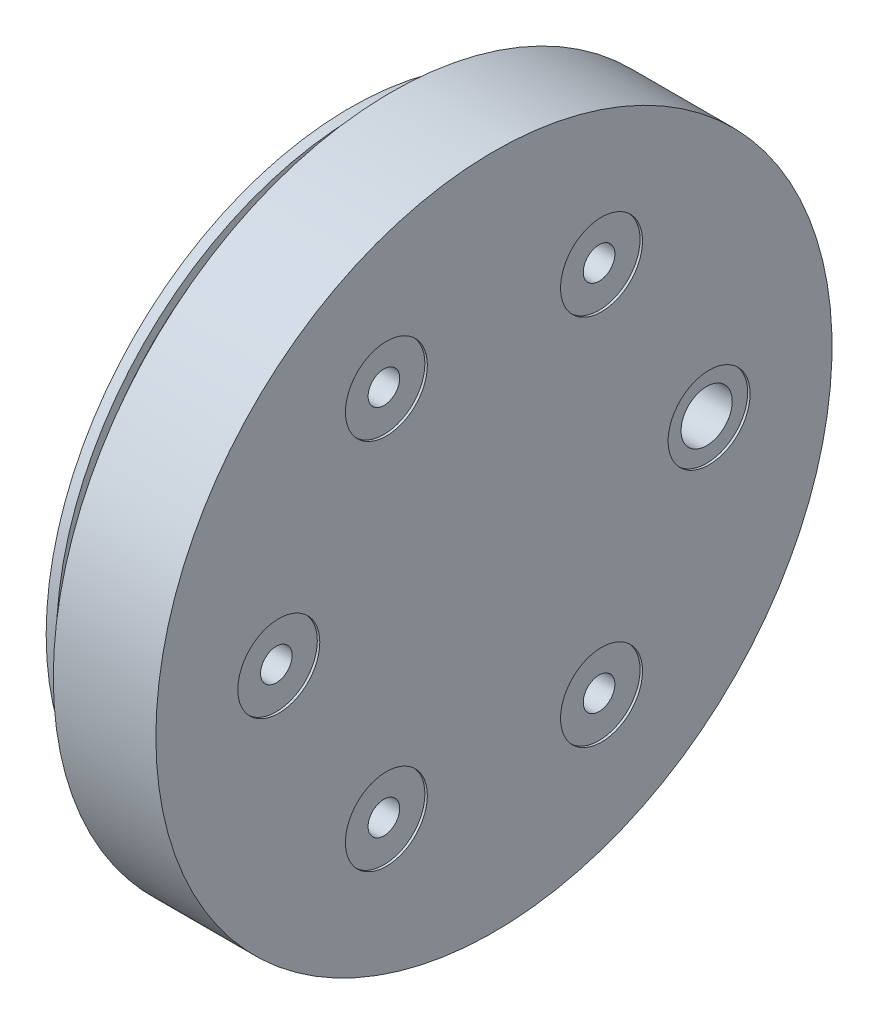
ISO-10303-21;
HEADER;
FILE_DESCRIPTION(('STEP AP214'),'2;1');
FILE_NAME('part.step','',(''),(''),'','','');
FILE_SCHEMA(('AUTOMOTIVE_DESIGN { 1 0 10303 214 1 1 1 1 }'));
ENDSEC;
DATA;
#1=APPLICATION_CONTEXT('core data for automotive mechanical design processes');
#2=APPLICATION_PROTOCOL_DEFINITION('international standard','automotive_design',2000,#1);
#3=PRODUCT_CONTEXT('',#1,'mechanical');
#4=PRODUCT('Part','Part','',(#3));
#5=PRODUCT_RELATED_PRODUCT_CATEGORY('part','',(#4));
#6=PRODUCT_DEFINITION_FORMATION('','',#4);
#7=PRODUCT_DEFINITION_CONTEXT('part definition',#1,'design');
#8=PRODUCT_DEFINITION('design','',#6,#7);
#9=PRODUCT_DEFINITION_SHAPE('','',#8);
#10=(LENGTH_UNIT() NAMED_UNIT(*) SI_UNIT(.MILLI.,.METRE.));
#11=(NAMED_UNIT(*) PLANE_ANGLE_UNIT() SI_UNIT($,.RADIAN.));
#12=(NAMED_UNIT(*) SI_UNIT($,.STERADIAN.) SOLID_ANGLE_UNIT());
#13=UNCERTAINTY_MEASURE_WITH_UNIT(LENGTH_MEASURE(1.E-05),#10,'distance_accuracy_value','');
#14=(GEOMETRIC_REPRESENTATION_CONTEXT(3) GLOBAL_UNCERTAINTY_ASSIGNED_CONTEXT((#13)) GLOBAL_UNIT_ASSIGNED_CONTEXT((#10,
#11,#12)) REPRESENTATION_CONTEXT('',''));
#15=CARTESIAN_POINT('',(0.,0.,0.));
#16=DIRECTION('',(0.,0.,1.));
#17=DIRECTION('',(1.,0.,0.));
#18=AXIS2_PLACEMENT_3D('',#15,#16,#17);
#19=CARTESIAN_POINT('',(0.,0.,-66.675));
#20=DIRECTION('',(1.,0.,0.));
#21=DIRECTION('',(0.,0.,-1.));
#22=AXIS2_PLACEMENT_3D('',#19,#20,#21);
#23=CYLINDRICAL_SURFACE('',#22,5.7531);
#24=CARTESIAN_POINT('',(6.78335511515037,0.,-66.675));
#25=DIRECTION('',(1.,0.,0.));
#26=DIRECTION('',(0.,0.,-1.));
#27=AXIS2_PLACEMENT_3D('',#24,#25,#26);
#28=CIRCLE('',#27,5.7531);
#29=CARTESIAN_POINT('',(6.78335511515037,0.,-72.4281));
#30=VERTEX_POINT('',#29);
#31=EDGE_CURVE('E41',#30,#30,#28,.T.);
#32=ORIENTED_EDGE('',*,*,#31,.T.);
#33=EDGE_LOOP('',(#32));
#34=FACE_BOUND('',#33,.T.);
#35=CARTESIAN_POINT('',(0.,0.,-66.675));
#36=DIRECTION('',(1.,0.,0.));
#37=DIRECTION('',(0.,0.,-1.));
#38=AXIS2_PLACEMENT_3D('',#35,#36,#37);
#39=CIRCLE('',#38,5.7531);
#40=CARTESIAN_POINT('',(0.,0.,-72.4281));
#41=VERTEX_POINT('',#40);
#42=EDGE_CURVE('E81',#41,#41,#39,.T.);
#43=ORIENTED_EDGE('',*,*,#42,.F.);
#44=EDGE_LOOP('',(#43));
#45=FACE_BOUND('',#44,.T.);
#46=ADVANCED_FACE('F37',(#34,#45),#23,.F.);
#47=CARTESIAN_POINT('',(0.,0.,0.));
#48=DIRECTION('',(-1.,0.,0.));
#49=DIRECTION('',(0.,0.,1.));
#50=AXIS2_PLACEMENT_3D('',#47,#48,#49);
#51=PLANE('',#50);
#52=CARTESIAN_POINT('',(0.,-57.7422437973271,-33.3375000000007));
#53=DIRECTION('',(1.,0.,0.));
#54=DIRECTION('',(0.,-0.866025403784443,0.499999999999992));
#55=AXIS2_PLACEMENT_3D('',#52,#53,#54);
#56=CIRCLE('',#55,4.9022);
#57=CARTESIAN_POINT('',(0.,-61.9876735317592,-30.8864000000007));
#58=VERTEX_POINT('',#57);
#59=EDGE_CURVE('E171',#58,#58,#56,.T.);
#60=ORIENTED_EDGE('',*,*,#59,.T.);
#61=EDGE_LOOP('',(#60));
#62=FACE_BOUND('',#61,.T.);
#63=CARTESIAN_POINT('',(0.,-57.7422437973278,33.3374999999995));
#64=DIRECTION('',(1.,0.,0.));
#65=DIRECTION('',(0.,0.,1.));
#66=AXIS2_PLACEMENT_3D('',#63,#64,#65);
#67=CIRCLE('',#66,4.9022);
#68=CARTESIAN_POINT('',(0.,-57.7422437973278,38.2396999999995));
#69=VERTEX_POINT('',#68);
#70=EDGE_CURVE('E165',#69,#69,#67,.T.);
#71=ORIENTED_EDGE('',*,*,#70,.T.);
#72=EDGE_LOOP('',(#71));
#73=FACE_BOUND('',#72,.T.);
#74=CARTESIAN_POINT('',(0.,-4.61436444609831E-13,66.675));
#75=DIRECTION('',(1.,0.,0.));
#76=DIRECTION('',(0.,0.866025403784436,0.500000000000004));
#77=AXIS2_PLACEMENT_3D('',#74,#75,#76);
#78=CIRCLE('',#77,4.9022);
#79=CARTESIAN_POINT('',(0.,4.2454297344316,69.1261));
#80=VERTEX_POINT('',#79);
#81=EDGE_CURVE('E159',#80,#80,#78,.T.);
#82=ORIENTED_EDGE('',*,*,#81,.T.);
#83=EDGE_LOOP('',(#82));
#84=FACE_BOUND('',#83,.T.);
#85=CARTESIAN_POINT('',(0.,57.7422437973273,33.3375000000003));
#86=DIRECTION('',(1.,0.,0.));
#87=DIRECTION('',(0.,0.86602540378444,-0.499999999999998));
#88=AXIS2_PLACEMENT_3D('',#85,#86,#87);
#89=CIRCLE('',#88,4.9022);
#90=CARTESIAN_POINT('',(0.,61.9876735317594,30.8864000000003));
#91=VERTEX_POINT('',#90);
#92=EDGE_CURVE('E153',#91,#91,#89,.T.);
#93=ORIENTED_EDGE('',*,*,#92,.T.);
#94=EDGE_LOOP('',(#93));
#95=FACE_BOUND('',#94,.T.);
#96=CARTESIAN_POINT('',(0.,57.7422437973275,-33.3374999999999));
#97=DIRECTION('',(1.,0.,0.));
#98=DIRECTION('',(0.,0.,-1.));
#99=AXIS2_PLACEMENT_3D('',#96,#97,#98);
#100=CIRCLE('',#99,4.9022);
#101=CARTESIAN_POINT('',(0.,57.7422437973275,-38.2396999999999));
#102=VERTEX_POINT('',#101);
#103=EDGE_CURVE('E142',#102,#102,#100,.T.);
#104=ORIENTED_EDGE('',*,*,#103,.T.);
#105=EDGE_LOOP('',(#104));
#106=FACE_BOUND('',#105,.T.);
#107=CARTESIAN_POINT('',(0.,59.69,-58.42));
#108=DIRECTION('',(-1.,0.,0.));
#109=DIRECTION('',(0.,0.,1.));
#110=AXIS2_PLACEMENT_3D('',#107,#108,#109);
#111=CIRCLE('',#110,2.41299999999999);
#112=CARTESIAN_POINT('',(0.,59.69,-56.007));
#113=VERTEX_POINT('',#112);
#114=EDGE_CURVE('E139',#113,#113,#111,.T.);
#115=ORIENTED_EDGE('',*,*,#114,.F.);
#116=EDGE_LOOP('',(#115));
#117=FACE_BOUND('',#116,.T.);
#118=CARTESIAN_POINT('',(0.,59.69,58.42));
#119=DIRECTION('',(-1.,0.,0.));
#120=DIRECTION('',(0.,0.,1.));
#121=AXIS2_PLACEMENT_3D('',#118,#119,#120);
#122=CIRCLE('',#121,2.413);
#123=CARTESIAN_POINT('',(0.,59.69,60.833));
#124=VERTEX_POINT('',#123);
#125=EDGE_CURVE('E133',#124,#124,#122,.T.);
#126=ORIENTED_EDGE('',*,*,#125,.F.);
#127=EDGE_LOOP('',(#126));
#128=FACE_BOUND('',#127,.T.);
#129=CARTESIAN_POINT('',(0.,-59.69,-58.42));
#130=DIRECTION('',(-1.,0.,0.));
#131=DIRECTION('',(0.,0.,1.));
#132=AXIS2_PLACEMENT_3D('',#129,#130,#131);
#133=CIRCLE('',#132,2.413);
#134=CARTESIAN_POINT('',(0.,-59.69,-56.007));
#135=VERTEX_POINT('',#134);
#136=EDGE_CURVE('E127',#135,#135,#133,.T.);
#137=ORIENTED_EDGE('',*,*,#136,.F.);
#138=EDGE_LOOP('',(#137));
#139=FACE_BOUND('',#138,.T.);
#140=CARTESIAN_POINT('',(0.,-59.69,58.42));
#141=DIRECTION('',(-1.,0.,0.));
#142=DIRECTION('',(0.,0.,1.));
#143=AXIS2_PLACEMENT_3D('',#140,#141,#142);
#144=CIRCLE('',#143,2.413);
#145=CARTESIAN_POINT('',(0.,-59.69,60.833));
#146=VERTEX_POINT('',#145);
#147=EDGE_CURVE('E121',#146,#146,#144,.T.);
#148=ORIENTED_EDGE('',*,*,#147,.F.);
#149=EDGE_LOOP('',(#148));
#150=FACE_BOUND('',#149,.T.);
#151=ORIENTED_EDGE('',*,*,#42,.T.);
#152=EDGE_LOOP('',(#151));
#153=FACE_BOUND('',#152,.T.);
#154=CARTESIAN_POINT('',(0.,0.,0.));
#155=DIRECTION('',(-1.,0.,0.));
#156=DIRECTION('',(0.,0.,1.));
#157=AXIS2_PLACEMENT_3D('',#154,#155,#156);
#158=CIRCLE('',#157,94.2848);
#159=CARTESIAN_POINT('',(0.,0.,94.2848));
#160=VERTEX_POINT('',#159);
#161=EDGE_CURVE('E10',#160,#160,#158,.T.);
#162=ORIENTED_EDGE('',*,*,#161,.T.);
#163=EDGE_LOOP('',(#162));
#164=FACE_BOUND('',#163,.T.);
#165=ADVANCED_FACE('F39',(#62,#73,#84,#95,#106,#117,#128,#139,#150,#153,#164),#51,.T.);
#166=CARTESIAN_POINT('',(-90.9789303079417,0.,0.));
#167=DIRECTION('',(-1.,0.,0.));
#168=DIRECTION('',(0.,0.,1.));
#169=AXIS2_PLACEMENT_3D('',#166,#167,#168);
#170=CYLINDRICAL_SURFACE('',#169,94.2848);
#171=CARTESIAN_POINT('',(3.175,0.,0.));
#172=DIRECTION('',(-1.,0.,0.));
#173=DIRECTION('',(0.,0.,1.));
#174=AXIS2_PLACEMENT_3D('',#171,#172,#173);
#175=CIRCLE('',#174,94.2848);
#176=CARTESIAN_POINT('',(3.175,0.,94.2848));
#177=VERTEX_POINT('',#176);
#178=EDGE_CURVE('E45',#177,#177,#175,.T.);
#179=ORIENTED_EDGE('',*,*,#178,.T.);
#180=EDGE_LOOP('',(#179));
#181=FACE_BOUND('',#180,.T.);
#182=ORIENTED_EDGE('',*,*,#161,.F.);
#183=EDGE_LOOP('',(#182));
#184=FACE_BOUND('',#183,.T.);
#185=ADVANCED_FACE('F228',(#181,#184),#170,.T.);
#186=CARTESIAN_POINT('',(3.175,94.2848,0.));
#187=DIRECTION('',(1.,0.,0.));
#188=DIRECTION('',(0.,0.,-1.));
#189=AXIS2_PLACEMENT_3D('',#186,#187,#188);
#190=PLANE('',#189);
#191=CARTESIAN_POINT('',(3.175,0.,0.));
#192=DIRECTION('',(-1.,0.,0.));
#193=DIRECTION('',(0.,0.,1.));
#194=AXIS2_PLACEMENT_3D('',#191,#192,#193);
#195=CIRCLE('',#194,91.44);
#196=CARTESIAN_POINT('',(3.175,0.,91.44));
#197=VERTEX_POINT('',#196);
#198=EDGE_CURVE('E49',#197,#197,#195,.T.);
#199=ORIENTED_EDGE('',*,*,#198,.T.);
#200=EDGE_LOOP('',(#199));
#201=FACE_BOUND('',#200,.T.);
#202=ORIENTED_EDGE('',*,*,#178,.F.);
#203=EDGE_LOOP('',(#202));
#204=FACE_BOUND('',#203,.T.);
#205=ADVANCED_FACE('F467',(#201,#204),#190,.T.);
#206=CARTESIAN_POINT('',(-90.9789303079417,0.,0.));
#207=DIRECTION('',(-1.,0.,0.));
#208=DIRECTION('',(0.,0.,1.));
#209=AXIS2_PLACEMENT_3D('',#206,#207,#208);
#210=CYLINDRICAL_SURFACE('',#209,91.44);
#211=CARTESIAN_POINT('',(7.493,0.,0.));
#212=DIRECTION('',(-1.,0.,0.));
#213=DIRECTION('',(0.,0.,1.));
#214=AXIS2_PLACEMENT_3D('',#211,#212,#213);
#215=CIRCLE('',#214,91.44);
#216=CARTESIAN_POINT('',(7.493,0.,91.44));
#217=VERTEX_POINT('',#216);
#218=EDGE_CURVE('E54',#217,#217,#215,.T.);
#219=ORIENTED_EDGE('',*,*,#218,.T.);
#220=EDGE_LOOP('',(#219));
#221=FACE_BOUND('',#220,.T.);
#222=ORIENTED_EDGE('',*,*,#198,.F.);
#223=EDGE_LOOP('',(#222));
#224=FACE_BOUND('',#223,.T.);
#225=ADVANCED_FACE('F474',(#221,#224),#210,.T.);
#226=CARTESIAN_POINT('',(7.493,91.44,0.));
#227=DIRECTION('',(-1.,0.,0.));
#228=DIRECTION('',(0.,0.,1.));
#229=AXIS2_PLACEMENT_3D('',#226,#227,#228);
#230=PLANE('',#229);
#231=CARTESIAN_POINT('',(7.493,0.,0.));
#232=DIRECTION('',(-1.,0.,0.));
#233=DIRECTION('',(0.,0.,1.));
#234=AXIS2_PLACEMENT_3D('',#231,#232,#233);
#235=CIRCLE('',#234,94.2848);
#236=CARTESIAN_POINT('',(7.493,0.,94.2848));
#237=VERTEX_POINT('',#236);
#238=EDGE_CURVE('E57',#237,#237,#235,.T.);
#239=ORIENTED_EDGE('',*,*,#238,.T.);
#240=EDGE_LOOP('',(#239));
#241=FACE_BOUND('',#240,.T.);
#242=ORIENTED_EDGE('',*,*,#218,.F.);
#243=EDGE_LOOP('',(#242));
#244=FACE_BOUND('',#243,.T.);
#245=ADVANCED_FACE('F482',(#241,#244),#230,.T.);
#246=CARTESIAN_POINT('',(-90.9789303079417,0.,0.));
#247=DIRECTION('',(-1.,0.,0.));
#248=DIRECTION('',(0.,0.,1.));
#249=AXIS2_PLACEMENT_3D('',#246,#247,#248);
#250=CYLINDRICAL_SURFACE('',#249,94.2848);
#251=CARTESIAN_POINT('',(12.7,0.,0.));
#252=DIRECTION('',(-1.,0.,0.));
#253=DIRECTION('',(0.,0.,1.));
#254=AXIS2_PLACEMENT_3D('',#251,#252,#253);
#255=CIRCLE('',#254,94.2848);
#256=CARTESIAN_POINT('',(12.7,0.,94.2848));
#257=VERTEX_POINT('',#256);
#258=EDGE_CURVE('E60',#257,#257,#255,.T.);
#259=ORIENTED_EDGE('',*,*,#258,.T.);
#260=EDGE_LOOP('',(#259));
#261=FACE_BOUND('',#260,.T.);
#262=ORIENTED_EDGE('',*,*,#238,.F.);
#263=EDGE_LOOP('',(#262));
#264=FACE_BOUND('',#263,.T.);
#265=ADVANCED_FACE('F490',(#261,#264),#250,.T.);
#266=CARTESIAN_POINT('',(12.7,96.52,0.));
#267=DIRECTION('',(1.,0.,0.));
#268=DIRECTION('',(0.,0.,-1.));
#269=AXIS2_PLACEMENT_3D('',#266,#267,#268);
#270=PLANE('',#269);
#271=ORIENTED_EDGE('',*,*,#258,.F.);
#272=EDGE_LOOP('',(#271));
#273=FACE_BOUND('',#272,.T.);
#274=CARTESIAN_POINT('',(12.7,0.,0.));
#275=DIRECTION('',(-1.,0.,0.));
#276=DIRECTION('',(0.,0.,1.));
#277=AXIS2_PLACEMENT_3D('',#274,#275,#276);
#278=CIRCLE('',#277,96.52);
#279=CARTESIAN_POINT('',(12.7,0.,96.52));
#280=VERTEX_POINT('',#279);
#281=EDGE_CURVE('E63',#280,#280,#278,.T.);
#282=ORIENTED_EDGE('',*,*,#281,.T.);
#283=EDGE_LOOP('',(#282));
#284=FACE_BOUND('',#283,.T.);
#285=ADVANCED_FACE('F498',(#273,#284),#270,.F.);
#286=CARTESIAN_POINT('',(-90.9789303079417,0.,0.));
#287=DIRECTION('',(-1.,0.,0.));
#288=DIRECTION('',(0.,0.,1.));
#289=AXIS2_PLACEMENT_3D('',#286,#287,#288);
#290=CYLINDRICAL_SURFACE('',#289,96.52);
#291=ORIENTED_EDGE('',*,*,#281,.F.);
#292=EDGE_LOOP('',(#291));
#293=FACE_BOUND('',#292,.T.);
#294=CARTESIAN_POINT('',(15.5448,0.,0.));
#295=DIRECTION('',(-1.,0.,0.));
#296=DIRECTION('',(0.,0.,1.));
#297=AXIS2_PLACEMENT_3D('',#294,#295,#296);
#298=CIRCLE('',#297,96.52);
#299=CARTESIAN_POINT('',(15.5448,0.,96.52));
#300=VERTEX_POINT('',#299);
#301=EDGE_CURVE('E66',#300,#300,#298,.T.);
#302=ORIENTED_EDGE('',*,*,#301,.T.);
#303=EDGE_LOOP('',(#302));
#304=FACE_BOUND('',#303,.T.);
#305=ADVANCED_FACE('F506',(#293,#304),#290,.T.);
#306=CARTESIAN_POINT('',(15.5448,100.838,0.));
#307=DIRECTION('',(1.,0.,0.));
#308=DIRECTION('',(0.,0.,-1.));
#309=AXIS2_PLACEMENT_3D('',#306,#307,#308);
#310=PLANE('',#309);
#311=ORIENTED_EDGE('',*,*,#301,.F.);
#312=EDGE_LOOP('',(#311));
#313=FACE_BOUND('',#312,.T.);
#314=CARTESIAN_POINT('',(15.5448,0.,0.));
#315=DIRECTION('',(-1.,0.,0.));
#316=DIRECTION('',(0.,0.,1.));
#317=AXIS2_PLACEMENT_3D('',#314,#315,#316);
#318=CIRCLE('',#317,100.838);
#319=CARTESIAN_POINT('',(15.5448,0.,100.838));
#320=VERTEX_POINT('',#319);
#321=EDGE_CURVE('E69',#320,#320,#318,.T.);
#322=ORIENTED_EDGE('',*,*,#321,.T.);
#323=EDGE_LOOP('',(#322));
#324=FACE_BOUND('',#323,.T.);
#325=ADVANCED_FACE('F514',(#313,#324),#310,.F.);
#326=CARTESIAN_POINT('',(-90.9789303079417,0.,0.));
#327=DIRECTION('',(-1.,0.,0.));
#328=DIRECTION('',(0.,0.,1.));
#329=AXIS2_PLACEMENT_3D('',#326,#327,#328);
#330=CYLINDRICAL_SURFACE('',#329,100.838);
#331=ORIENTED_EDGE('',*,*,#321,.F.);
#332=EDGE_LOOP('',(#331));
#333=FACE_BOUND('',#332,.T.);
#334=CARTESIAN_POINT('',(12.7,0.,0.));
#335=DIRECTION('',(-1.,0.,0.));
#336=DIRECTION('',(0.,0.,1.));
#337=AXIS2_PLACEMENT_3D('',#334,#335,#336);
#338=CIRCLE('',#337,100.838);
#339=CARTESIAN_POINT('',(12.7,0.,100.838));
#340=VERTEX_POINT('',#339);
#341=EDGE_CURVE('E72',#340,#340,#338,.T.);
#342=ORIENTED_EDGE('',*,*,#341,.T.);
#343=EDGE_LOOP('',(#342));
#344=FACE_BOUND('',#343,.T.);
#345=ADVANCED_FACE('F217',(#333,#344),#330,.F.);
#346=CARTESIAN_POINT('',(12.7,104.775,0.));
#347=DIRECTION('',(1.,0.,0.));
#348=DIRECTION('',(0.,0.,-1.));
#349=AXIS2_PLACEMENT_3D('',#346,#347,#348);
#350=PLANE('',#349);
#351=ORIENTED_EDGE('',*,*,#341,.F.);
#352=EDGE_LOOP('',(#351));
#353=FACE_BOUND('',#352,.T.);
#354=CARTESIAN_POINT('',(12.7,0.,0.));
#355=DIRECTION('',(-1.,0.,0.));
#356=DIRECTION('',(0.,0.,1.));
#357=AXIS2_PLACEMENT_3D('',#354,#355,#356);
#358=CIRCLE('',#357,104.775);
#359=CARTESIAN_POINT('',(12.7,0.,104.775));
#360=VERTEX_POINT('',#359);
#361=EDGE_CURVE('E75',#360,#360,#358,.T.);
#362=ORIENTED_EDGE('',*,*,#361,.T.);
#363=EDGE_LOOP('',(#362));
#364=FACE_BOUND('',#363,.T.);
#365=ADVANCED_FACE('F211',(#353,#364),#350,.F.);
#366=CARTESIAN_POINT('',(-90.9789303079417,0.,0.));
#367=DIRECTION('',(-1.,0.,0.));
#368=DIRECTION('',(0.,0.,1.));
#369=AXIS2_PLACEMENT_3D('',#366,#367,#368);
#370=CYLINDRICAL_SURFACE('',#369,104.775);
#371=ORIENTED_EDGE('',*,*,#361,.F.);
#372=EDGE_LOOP('',(#371));
#373=FACE_BOUND('',#372,.T.);
#374=CARTESIAN_POINT('',(44.4917844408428,0.,0.));
#375=DIRECTION('',(-1.,0.,0.));
#376=DIRECTION('',(0.,0.,1.));
#377=AXIS2_PLACEMENT_3D('',#374,#375,#376);
#378=CIRCLE('',#377,104.775);
#379=CARTESIAN_POINT('',(44.4917844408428,0.,104.775));
#380=VERTEX_POINT('',#379);
#381=EDGE_CURVE('E78',#380,#380,#378,.T.);
#382=ORIENTED_EDGE('',*,*,#381,.T.);
#383=EDGE_LOOP('',(#382));
#384=FACE_BOUND('',#383,.T.);
#385=ADVANCED_FACE('F205',(#373,#384),#370,.T.);
#386=CARTESIAN_POINT('',(44.4917844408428,104.775,0.));
#387=DIRECTION('',(1.,0.,0.));
#388=DIRECTION('',(0.,0.,-1.));
#389=AXIS2_PLACEMENT_3D('',#386,#387,#388);
#390=PLANE('',#389);
#391=CARTESIAN_POINT('',(44.4917844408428,-57.7422437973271,-33.3375000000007));
#392=DIRECTION('',(1.,0.,0.));
#393=DIRECTION('',(0.,-0.866025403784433,-0.50000000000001));
#394=AXIS2_PLACEMENT_3D('',#391,#392,#393);
#395=CIRCLE('',#394,12.7);
#396=CARTESIAN_POINT('',(44.4917844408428,-57.7422437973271,-46.0375000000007));
#397=VERTEX_POINT('',#396);
#398=EDGE_CURVE('E115',#397,#397,#395,.T.);
#399=ORIENTED_EDGE('',*,*,#398,.F.);
#400=EDGE_LOOP('',(#399));
#401=FACE_BOUND('',#400,.T.);
#402=CARTESIAN_POINT('',(44.4917844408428,-57.7422437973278,33.3374999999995));
#403=DIRECTION('',(1.,0.,0.));
#404=DIRECTION('',(0.,-0.866025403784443,0.499999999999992));
#405=AXIS2_PLACEMENT_3D('',#402,#403,#404);
#406=CIRCLE('',#405,12.7);
#407=CARTESIAN_POINT('',(44.4917844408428,-57.7422437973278,20.6374999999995));
#408=VERTEX_POINT('',#407);
#409=EDGE_CURVE('E109',#408,#408,#406,.T.);
#410=ORIENTED_EDGE('',*,*,#409,.F.);
#411=EDGE_LOOP('',(#410));
#412=FACE_BOUND('',#411,.T.);
#413=CARTESIAN_POINT('',(44.4917844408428,-4.65589306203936E-13,66.675));
#414=DIRECTION('',(1.,0.,0.));
#415=DIRECTION('',(0.,0.,1.));
#416=AXIS2_PLACEMENT_3D('',#413,#414,#415);
#417=CIRCLE('',#416,12.7);
#418=CARTESIAN_POINT('',(44.4917844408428,-4.65589306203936E-13,53.975));
#419=VERTEX_POINT('',#418);
#420=EDGE_CURVE('E103',#419,#419,#417,.T.);
#421=ORIENTED_EDGE('',*,*,#420,.F.);
#422=EDGE_LOOP('',(#421));
#423=FACE_BOUND('',#422,.T.);
#424=CARTESIAN_POINT('',(44.4917844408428,57.7422437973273,33.3375000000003));
#425=DIRECTION('',(1.,0.,0.));
#426=DIRECTION('',(0.,0.866025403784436,0.500000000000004));
#427=AXIS2_PLACEMENT_3D('',#424,#425,#426);
#428=CIRCLE('',#427,12.7);
#429=CARTESIAN_POINT('',(44.4917844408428,57.7422437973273,20.6375000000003));
#430=VERTEX_POINT('',#429);
#431=EDGE_CURVE('E97',#430,#430,#428,.T.);
#432=ORIENTED_EDGE('',*,*,#431,.F.);
#433=EDGE_LOOP('',(#432));
#434=FACE_BOUND('',#433,.T.);
#435=CARTESIAN_POINT('',(44.4917844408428,57.7422437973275,-33.3374999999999));
#436=DIRECTION('',(1.,0.,0.));
#437=DIRECTION('',(0.,0.86602540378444,-0.499999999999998));
#438=AXIS2_PLACEMENT_3D('',#435,#436,#437);
#439=CIRCLE('',#438,12.7);
#440=CARTESIAN_POINT('',(44.4917844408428,57.7422437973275,-46.0374999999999));
#441=VERTEX_POINT('',#440);
#442=EDGE_CURVE('E91',#441,#441,#439,.T.);
#443=ORIENTED_EDGE('',*,*,#442,.F.);
#444=EDGE_LOOP('',(#443));
#445=FACE_BOUND('',#444,.T.);
#446=CARTESIAN_POINT('',(44.4917844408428,0.,-66.675));
#447=DIRECTION('',(1.,0.,0.));
#448=DIRECTION('',(0.,0.,-1.));
#449=AXIS2_PLACEMENT_3D('',#446,#447,#448);
#450=CIRCLE('',#449,12.7);
#451=CARTESIAN_POINT('',(44.4917844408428,0.,-79.375));
#452=VERTEX_POINT('',#451);
#453=EDGE_CURVE('E85',#452,#452,#450,.T.);
#454=ORIENTED_EDGE('',*,*,#453,.F.);
#455=EDGE_LOOP('',(#454));
#456=FACE_BOUND('',#455,.T.);
#457=ORIENTED_EDGE('',*,*,#381,.F.);
#458=EDGE_LOOP('',(#457));
#459=FACE_BOUND('',#458,.T.);
#460=ADVANCED_FACE('F193',(#401,#412,#423,#434,#445,#456,#459),#390,.T.);
#461=CARTESIAN_POINT('',(43.7297844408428,0.,-66.675));
#462=DIRECTION('',(1.,0.,0.));
#463=DIRECTION('',(0.,0.,-1.));
#464=AXIS2_PLACEMENT_3D('',#461,#462,#463);
#465=PLANE('',#464);
#466=CARTESIAN_POINT('',(43.7297844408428,0.,-66.675));
#467=DIRECTION('',(1.,0.,0.));
#468=DIRECTION('',(0.,0.,-1.));
#469=AXIS2_PLACEMENT_3D('',#466,#467,#468);
#470=CIRCLE('',#469,7.9375);
#471=CARTESIAN_POINT('',(43.7297844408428,0.,-74.6125));
#472=VERTEX_POINT('',#471);
#473=EDGE_CURVE('E183',#472,#472,#470,.T.);
#474=ORIENTED_EDGE('',*,*,#473,.F.);
#475=EDGE_LOOP('',(#474));
#476=FACE_BOUND('',#475,.T.);
#477=CARTESIAN_POINT('',(43.7297844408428,0.,-66.675));
#478=DIRECTION('',(1.,0.,0.));
#479=DIRECTION('',(0.,0.,-1.));
#480=AXIS2_PLACEMENT_3D('',#477,#478,#479);
#481=CIRCLE('',#480,12.7);
#482=CARTESIAN_POINT('',(43.7297844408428,0.,-79.375));
#483=VERTEX_POINT('',#482);
#484=EDGE_CURVE('E84',#483,#483,#481,.T.);
#485=ORIENTED_EDGE('',*,*,#484,.T.);
#486=EDGE_LOOP('',(#485));
#487=FACE_BOUND('',#486,.T.);
#488=ADVANCED_FACE('F189',(#476,#487),#465,.T.);
#489=CARTESIAN_POINT('',(43.7297844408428,0.,-66.675));
#490=DIRECTION('',(1.,0.,0.));
#491=DIRECTION('',(0.,0.,-1.));
#492=AXIS2_PLACEMENT_3D('',#489,#490,#491);
#493=CYLINDRICAL_SURFACE('',#492,12.7);
#494=CARTESIAN_POINT('',(43.7297844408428,0.,-79.375));
#495=CARTESIAN_POINT('',(43.7377219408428,0.,-79.375));
#496=CARTESIAN_POINT('',(43.7456594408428,0.,-79.375));
#497=CARTESIAN_POINT('',(43.7615344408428,0.,-79.375));
#498=CARTESIAN_POINT('',(43.7694719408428,0.,-79.375));
#499=CARTESIAN_POINT('',(43.7853469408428,0.,-79.375));
#500=CARTESIAN_POINT('',(43.7932844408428,0.,-79.375));
#501=CARTESIAN_POINT('',(43.8091594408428,0.,-79.375));
#502=CARTESIAN_POINT('',(43.8170969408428,0.,-79.375));
#503=CARTESIAN_POINT('',(43.8329719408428,0.,-79.375));
#504=CARTESIAN_POINT('',(43.8409094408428,0.,-79.375));
#505=CARTESIAN_POINT('',(43.8567844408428,0.,-79.375));
#506=CARTESIAN_POINT('',(43.8647219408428,0.,-79.375));
#507=CARTESIAN_POINT('',(43.8805969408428,0.,-79.375));
#508=CARTESIAN_POINT('',(43.8885344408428,0.,-79.375));
#509=CARTESIAN_POINT('',(43.9044094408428,0.,-79.375));
#510=CARTESIAN_POINT('',(43.9123469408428,0.,-79.375));
#511=CARTESIAN_POINT('',(43.9282219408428,0.,-79.375));
#512=CARTESIAN_POINT('',(43.9361594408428,0.,-79.375));
#513=CARTESIAN_POINT('',(43.9520344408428,0.,-79.375));
#514=CARTESIAN_POINT('',(43.9599719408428,0.,-79.375));
#515=CARTESIAN_POINT('',(43.9758469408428,0.,-79.375));
#516=CARTESIAN_POINT('',(43.9837844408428,0.,-79.375));
#517=CARTESIAN_POINT('',(43.9996594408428,0.,-79.375));
#518=CARTESIAN_POINT('',(44.0075969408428,0.,-79.375));
#519=CARTESIAN_POINT('',(44.0234719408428,0.,-79.375));
#520=CARTESIAN_POINT('',(44.0314094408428,0.,-79.375));
#521=CARTESIAN_POINT('',(44.0472844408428,0.,-79.375));
#522=CARTESIAN_POINT('',(44.0552219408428,0.,-79.375));
#523=CARTESIAN_POINT('',(44.0710969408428,0.,-79.375));
#524=CARTESIAN_POINT('',(44.0790344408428,0.,-79.375));
#525=CARTESIAN_POINT('',(44.0949094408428,0.,-79.375));
#526=CARTESIAN_POINT('',(44.1028469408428,0.,-79.375));
#527=CARTESIAN_POINT('',(44.1187219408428,0.,-79.375));
#528=CARTESIAN_POINT('',(44.1266594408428,0.,-79.375));
#529=CARTESIAN_POINT('',(44.1425344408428,0.,-79.375));
#530=CARTESIAN_POINT('',(44.1504719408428,0.,-79.375));
#531=CARTESIAN_POINT('',(44.1663469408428,0.,-79.375));
#532=CARTESIAN_POINT('',(44.1742844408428,0.,-79.375));
#533=CARTESIAN_POINT('',(44.1901594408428,0.,-79.375));
#534=CARTESIAN_POINT('',(44.1980969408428,0.,-79.375));
#535=CARTESIAN_POINT('',(44.2139719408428,0.,-79.375));
#536=CARTESIAN_POINT('',(44.2219094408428,0.,-79.375));
#537=CARTESIAN_POINT('',(44.2377844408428,0.,-79.375));
#538=CARTESIAN_POINT('',(44.2457219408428,0.,-79.375));
#539=CARTESIAN_POINT('',(44.2615969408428,0.,-79.375));
#540=CARTESIAN_POINT('',(44.2695344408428,0.,-79.375));
#541=CARTESIAN_POINT('',(44.2854094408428,0.,-79.375));
#542=CARTESIAN_POINT('',(44.2933469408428,0.,-79.375));
#543=CARTESIAN_POINT('',(44.3092219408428,0.,-79.375));
#544=CARTESIAN_POINT('',(44.3171594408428,0.,-79.375));
#545=CARTESIAN_POINT('',(44.3330344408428,0.,-79.375));
#546=CARTESIAN_POINT('',(44.3409719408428,0.,-79.375));
#547=CARTESIAN_POINT('',(44.3568469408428,0.,-79.375));
#548=CARTESIAN_POINT('',(44.3647844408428,0.,-79.375));
#549=CARTESIAN_POINT('',(44.3806594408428,0.,-79.375));
#550=CARTESIAN_POINT('',(44.3885969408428,0.,-79.375));
#551=CARTESIAN_POINT('',(44.4044719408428,0.,-79.375));
#552=CARTESIAN_POINT('',(44.4124094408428,0.,-79.375));
#553=CARTESIAN_POINT('',(44.4282844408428,0.,-79.375));
#554=CARTESIAN_POINT('',(44.4362219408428,0.,-79.375));
#555=CARTESIAN_POINT('',(44.4520969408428,0.,-79.375));
#556=CARTESIAN_POINT('',(44.4600344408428,0.,-79.375));
#557=CARTESIAN_POINT('',(44.4759094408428,0.,-79.375));
#558=CARTESIAN_POINT('',(44.4838469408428,0.,-79.375));
#559=CARTESIAN_POINT('',(44.4917844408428,0.,-79.375));
#560=B_SPLINE_CURVE_WITH_KNOTS('',3,(#494,#495,#496,#497,#498,#499,#500,#501,#502,#503,#504,
#505,#506,#507,#508,#509,#510,#511,#512,#513,#514,#515,#516,#517,#518,#519,#520,#521,#522,#523,
#524,#525,#526,#527,#528,#529,#530,#531,#532,#533,#534,#535,#536,#537,#538,#539,#540,#541,#542,
#543,#544,#545,#546,#547,#548,#549,#550,#551,#552,#553,#554,#555,#556,#557,#558,#559),
.UNSPECIFIED.,.F.,.F.,(4,2,2,2,2,2,2,2,2,2,2,2,2,2,2,2,2,2,2,2,2,2,2,2,2,2,2,2,2,2,2,2,4),(0.,
0.0238125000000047,0.0476250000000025,0.0714375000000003,0.0952500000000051,0.119062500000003,
0.142875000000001,0.166687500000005,0.190500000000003,0.214312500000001,0.238125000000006,
0.261937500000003,0.285750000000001,0.309562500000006,0.333375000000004,0.357187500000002,
0.381000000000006,0.404812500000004,0.428625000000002,0.4524375,0.476250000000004,
0.500062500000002,0.523875,0.547687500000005,0.571500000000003,0.5953125,0.619125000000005,
0.642937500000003,0.666750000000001,0.690562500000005,0.714375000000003,0.738187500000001,
0.762000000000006),.UNSPECIFIED.);
#561=EDGE_CURVE('BSEAM192',#483,#452,#560,.T.);
#562=ORIENTED_EDGE('',*,*,#484,.F.);
#563=ORIENTED_EDGE('',*,*,#453,.T.);
#564=ORIENTED_EDGE('',*,*,#561,.T.);
#565=ORIENTED_EDGE('',*,*,#561,.F.);
#566=EDGE_LOOP('',(#562,#564,#563,#565));
#567=FACE_BOUND('',#566,.T.);
#568=ADVANCED_FACE('F192',(#567),#493,.F.);
#569=CARTESIAN_POINT('',(43.7297844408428,57.7422437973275,-33.3374999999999));
#570=DIRECTION('',(1.,0.,0.));
#571=DIRECTION('',(0.,0.,-1.));
#572=AXIS2_PLACEMENT_3D('',#569,#570,#571);
#573=CYLINDRICAL_SURFACE('',#572,12.7);
#574=CARTESIAN_POINT('',(43.7297844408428,57.7422437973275,-33.3374999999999));
#575=DIRECTION('',(1.,0.,0.));
#576=DIRECTION('',(0.,0.86602540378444,-0.499999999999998));
#577=AXIS2_PLACEMENT_3D('',#574,#575,#576);
#578=CIRCLE('',#577,12.7);
#579=CARTESIAN_POINT('',(43.7297844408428,57.7422437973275,-46.0374999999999));
#580=VERTEX_POINT('',#579);
#581=EDGE_CURVE('E88',#580,#580,#578,.T.);
#582=CARTESIAN_POINT('',(43.7297844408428,57.7422437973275,-46.0374999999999));
#583=CARTESIAN_POINT('',(43.7377219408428,57.7422437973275,-46.0374999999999));
#584=CARTESIAN_POINT('',(43.7456594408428,57.7422437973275,-46.0374999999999));
#585=CARTESIAN_POINT('',(43.7615344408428,57.7422437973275,-46.0374999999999));
#586=CARTESIAN_POINT('',(43.7694719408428,57.7422437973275,-46.0374999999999));
#587=CARTESIAN_POINT('',(43.7853469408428,57.7422437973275,-46.0374999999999));
#588=CARTESIAN_POINT('',(43.7932844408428,57.7422437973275,-46.0374999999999));
#589=CARTESIAN_POINT('',(43.8091594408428,57.7422437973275,-46.0374999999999));
#590=CARTESIAN_POINT('',(43.8170969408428,57.7422437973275,-46.0374999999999));
#591=CARTESIAN_POINT('',(43.8329719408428,57.7422437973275,-46.0374999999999));
#592=CARTESIAN_POINT('',(43.8409094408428,57.7422437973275,-46.0374999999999));
#593=CARTESIAN_POINT('',(43.8567844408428,57.7422437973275,-46.0374999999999));
#594=CARTESIAN_POINT('',(43.8647219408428,57.7422437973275,-46.0374999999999));
#595=CARTESIAN_POINT('',(43.8805969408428,57.7422437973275,-46.0374999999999));
#596=CARTESIAN_POINT('',(43.8885344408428,57.7422437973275,-46.0374999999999));
#597=CARTESIAN_POINT('',(43.9044094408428,57.7422437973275,-46.0374999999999));
#598=CARTESIAN_POINT('',(43.9123469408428,57.7422437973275,-46.0374999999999));
#599=CARTESIAN_POINT('',(43.9282219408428,57.7422437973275,-46.0374999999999));
#600=CARTESIAN_POINT('',(43.9361594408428,57.7422437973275,-46.0374999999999));
#601=CARTESIAN_POINT('',(43.9520344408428,57.7422437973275,-46.0374999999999));
#602=CARTESIAN_POINT('',(43.9599719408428,57.7422437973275,-46.0374999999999));
#603=CARTESIAN_POINT('',(43.9758469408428,57.7422437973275,-46.0374999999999));
#604=CARTESIAN_POINT('',(43.9837844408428,57.7422437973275,-46.0374999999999));
#605=CARTESIAN_POINT('',(43.9996594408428,57.7422437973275,-46.0374999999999));
#606=CARTESIAN_POINT('',(44.0075969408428,57.7422437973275,-46.0374999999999));
#607=CARTESIAN_POINT('',(44.0234719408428,57.7422437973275,-46.0374999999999));
#608=CARTESIAN_POINT('',(44.0314094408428,57.7422437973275,-46.0374999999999));
#609=CARTESIAN_POINT('',(44.0472844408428,57.7422437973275,-46.0374999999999));
#610=CARTESIAN_POINT('',(44.0552219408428,57.7422437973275,-46.0374999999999));
#611=CARTESIAN_POINT('',(44.0710969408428,57.7422437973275,-46.0374999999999));
#612=CARTESIAN_POINT('',(44.0790344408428,57.7422437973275,-46.0374999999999));
#613=CARTESIAN_POINT('',(44.0949094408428,57.7422437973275,-46.0374999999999));
#614=CARTESIAN_POINT('',(44.1028469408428,57.7422437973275,-46.0374999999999));
#615=CARTESIAN_POINT('',(44.1187219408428,57.7422437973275,-46.0374999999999));
#616=CARTESIAN_POINT('',(44.1266594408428,57.7422437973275,-46.0374999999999));
#617=CARTESIAN_POINT('',(44.1425344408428,57.7422437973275,-46.0374999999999));
#618=CARTESIAN_POINT('',(44.1504719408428,57.7422437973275,-46.0374999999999));
#619=CARTESIAN_POINT('',(44.1663469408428,57.7422437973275,-46.0374999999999));
#620=CARTESIAN_POINT('',(44.1742844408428,57.7422437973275,-46.0374999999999));
#621=CARTESIAN_POINT('',(44.1901594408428,57.7422437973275,-46.0374999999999));
#622=CARTESIAN_POINT('',(44.1980969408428,57.7422437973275,-46.0374999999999));
#623=CARTESIAN_POINT('',(44.2139719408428,57.7422437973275,-46.0374999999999));
#624=CARTESIAN_POINT('',(44.2219094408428,57.7422437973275,-46.0374999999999));
#625=CARTESIAN_POINT('',(44.2377844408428,57.7422437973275,-46.0374999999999));
#626=CARTESIAN_POINT('',(44.2457219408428,57.7422437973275,-46.0374999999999));
#627=CARTESIAN_POINT('',(44.2615969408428,57.7422437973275,-46.0374999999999));
#628=CARTESIAN_POINT('',(44.2695344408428,57.7422437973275,-46.0374999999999));
#629=CARTESIAN_POINT('',(44.2854094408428,57.7422437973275,-46.0374999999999));
#630=CARTESIAN_POINT('',(44.2933469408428,57.7422437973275,-46.0374999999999));
#631=CARTESIAN_POINT('',(44.3092219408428,57.7422437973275,-46.0374999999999));
#632=CARTESIAN_POINT('',(44.3171594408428,57.7422437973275,-46.0374999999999));
#633=CARTESIAN_POINT('',(44.3330344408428,57.7422437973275,-46.0374999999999));
#634=CARTESIAN_POINT('',(44.3409719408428,57.7422437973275,-46.0374999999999));
#635=CARTESIAN_POINT('',(44.3568469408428,57.7422437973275,-46.0374999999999));
#636=CARTESIAN_POINT('',(44.3647844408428,57.7422437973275,-46.0374999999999));
#637=CARTESIAN_POINT('',(44.3806594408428,57.7422437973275,-46.0374999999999));
#638=CARTESIAN_POINT('',(44.3885969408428,57.7422437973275,-46.0374999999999));
#639=CARTESIAN_POINT('',(44.4044719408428,57.7422437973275,-46.0374999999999));
#640=CARTESIAN_POINT('',(44.4124094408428,57.7422437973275,-46.0374999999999));
#641=CARTESIAN_POINT('',(44.4282844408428,57.7422437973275,-46.0374999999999));
#642=CARTESIAN_POINT('',(44.4362219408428,57.7422437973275,-46.0374999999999));
#643=CARTESIAN_POINT('',(44.4520969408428,57.7422437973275,-46.0374999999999));
#644=CARTESIAN_POINT('',(44.4600344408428,57.7422437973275,-46.0374999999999));
#645=CARTESIAN_POINT('',(44.4759094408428,57.7422437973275,-46.0374999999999));
#646=CARTESIAN_POINT('',(44.4838469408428,57.7422437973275,-46.0374999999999));
#647=CARTESIAN_POINT('',(44.4917844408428,57.7422437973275,-46.0374999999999));
#648=B_SPLINE_CURVE_WITH_KNOTS('',3,(#582,#583,#584,#585,#586,#587,#588,#589,#590,#591,#592,
#593,#594,#595,#596,#597,#598,#599,#600,#601,#602,#603,#604,#605,#606,#607,#608,#609,#610,#611,
#612,#613,#614,#615,#616,#617,#618,#619,#620,#621,#622,#623,#624,#625,#626,#627,#628,#629,#630,
#631,#632,#633,#634,#635,#636,#637,#638,#639,#640,#641,#642,#643,#644,#645,#646,#647),
.UNSPECIFIED.,.F.,.F.,(4,2,2,2,2,2,2,2,2,2,2,2,2,2,2,2,2,2,2,2,2,2,2,2,2,2,2,2,2,2,2,2,4),(0.,
0.0238125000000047,0.0476250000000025,0.0714375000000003,0.0952500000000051,0.119062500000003,
0.142875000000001,0.166687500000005,0.190500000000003,0.214312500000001,0.238125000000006,
0.261937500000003,0.285750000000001,0.309562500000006,0.333375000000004,0.357187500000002,
0.381000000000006,0.404812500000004,0.428625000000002,0.4524375,0.476250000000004,
0.500062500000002,0.523875,0.547687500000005,0.571500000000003,0.5953125,0.619125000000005,
0.642937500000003,0.666750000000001,0.690562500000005,0.714375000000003,0.738187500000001,
0.762000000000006),.UNSPECIFIED.);
#649=EDGE_CURVE('BSEAM199',#580,#441,#648,.T.);
#650=ORIENTED_EDGE('',*,*,#581,.F.);
#651=ORIENTED_EDGE('',*,*,#442,.T.);
#652=ORIENTED_EDGE('',*,*,#649,.T.);
#653=ORIENTED_EDGE('',*,*,#649,.F.);
#654=EDGE_LOOP('',(#650,#652,#651,#653));
#655=FACE_BOUND('',#654,.T.);
#656=ADVANCED_FACE('F199',(#655),#573,.F.);
#657=CARTESIAN_POINT('',(43.7297844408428,57.7422437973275,-33.3374999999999));
#658=DIRECTION('',(1.,0.,0.));
#659=DIRECTION('',(0.,0.86602540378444,-0.499999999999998));
#660=AXIS2_PLACEMENT_3D('',#657,#658,#659);
#661=PLANE('',#660);
#662=CARTESIAN_POINT('',(43.7297844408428,57.7422437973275,-33.3374999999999));
#663=DIRECTION('',(1.,0.,0.));
#664=DIRECTION('',(0.,0.,-1.));
#665=AXIS2_PLACEMENT_3D('',#662,#663,#664);
#666=CIRCLE('',#665,4.9022);
#667=CARTESIAN_POINT('',(43.7297844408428,57.7422437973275,-38.2396999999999));
#668=VERTEX_POINT('',#667);
#669=EDGE_CURVE('E145',#668,#668,#666,.T.);
#670=ORIENTED_EDGE('',*,*,#669,.F.);
#671=EDGE_LOOP('',(#670));
#672=FACE_BOUND('',#671,.T.);
#673=ORIENTED_EDGE('',*,*,#581,.T.);
#674=EDGE_LOOP('',(#673));
#675=FACE_BOUND('',#674,.T.);
#676=ADVANCED_FACE('F235',(#672,#675),#661,.T.);
#677=CARTESIAN_POINT('',(43.7297844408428,57.7422437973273,33.3375000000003));
#678=DIRECTION('',(1.,0.,0.));
#679=DIRECTION('',(0.,0.,-1.));
#680=AXIS2_PLACEMENT_3D('',#677,#678,#679);
#681=CYLINDRICAL_SURFACE('',#680,12.7);
#682=CARTESIAN_POINT('',(43.7297844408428,57.7422437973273,33.3375000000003));
#683=DIRECTION('',(1.,0.,0.));
#684=DIRECTION('',(0.,0.866025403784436,0.500000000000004));
#685=AXIS2_PLACEMENT_3D('',#682,#683,#684);
#686=CIRCLE('',#685,12.7);
#687=CARTESIAN_POINT('',(43.7297844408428,57.7422437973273,20.6375000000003));
#688=VERTEX_POINT('',#687);
#689=EDGE_CURVE('E94',#688,#688,#686,.T.);
#690=CARTESIAN_POINT('',(43.7297844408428,57.7422437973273,20.6375000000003));
#691=CARTESIAN_POINT('',(43.7377219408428,57.7422437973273,20.6375000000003));
#692=CARTESIAN_POINT('',(43.7456594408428,57.7422437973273,20.6375000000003));
#693=CARTESIAN_POINT('',(43.7615344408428,57.7422437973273,20.6375000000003));
#694=CARTESIAN_POINT('',(43.7694719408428,57.7422437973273,20.6375000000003));
#695=CARTESIAN_POINT('',(43.7853469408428,57.7422437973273,20.6375000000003));
#696=CARTESIAN_POINT('',(43.7932844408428,57.7422437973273,20.6375000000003));
#697=CARTESIAN_POINT('',(43.8091594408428,57.7422437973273,20.6375000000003));
#698=CARTESIAN_POINT('',(43.8170969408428,57.7422437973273,20.6375000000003));
#699=CARTESIAN_POINT('',(43.8329719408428,57.7422437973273,20.6375000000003));
#700=CARTESIAN_POINT('',(43.8409094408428,57.7422437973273,20.6375000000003));
#701=CARTESIAN_POINT('',(43.8567844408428,57.7422437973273,20.6375000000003));
#702=CARTESIAN_POINT('',(43.8647219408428,57.7422437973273,20.6375000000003));
#703=CARTESIAN_POINT('',(43.8805969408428,57.7422437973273,20.6375000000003));
#704=CARTESIAN_POINT('',(43.8885344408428,57.7422437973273,20.6375000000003));
#705=CARTESIAN_POINT('',(43.9044094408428,57.7422437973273,20.6375000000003));
#706=CARTESIAN_POINT('',(43.9123469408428,57.7422437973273,20.6375000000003));
#707=CARTESIAN_POINT('',(43.9282219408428,57.7422437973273,20.6375000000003));
#708=CARTESIAN_POINT('',(43.9361594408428,57.7422437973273,20.6375000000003));
#709=CARTESIAN_POINT('',(43.9520344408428,57.7422437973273,20.6375000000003));
#710=CARTESIAN_POINT('',(43.9599719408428,57.7422437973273,20.6375000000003));
#711=CARTESIAN_POINT('',(43.9758469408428,57.7422437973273,20.6375000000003));
#712=CARTESIAN_POINT('',(43.9837844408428,57.7422437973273,20.6375000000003));
#713=CARTESIAN_POINT('',(43.9996594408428,57.7422437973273,20.6375000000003));
#714=CARTESIAN_POINT('',(44.0075969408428,57.7422437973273,20.6375000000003));
#715=CARTESIAN_POINT('',(44.0234719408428,57.7422437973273,20.6375000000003));
#716=CARTESIAN_POINT('',(44.0314094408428,57.7422437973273,20.6375000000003));
#717=CARTESIAN_POINT('',(44.0472844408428,57.7422437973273,20.6375000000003));
#718=CARTESIAN_POINT('',(44.0552219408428,57.7422437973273,20.6375000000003));
#719=CARTESIAN_POINT('',(44.0710969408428,57.7422437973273,20.6375000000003));
#720=CARTESIAN_POINT('',(44.0790344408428,57.7422437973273,20.6375000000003));
#721=CARTESIAN_POINT('',(44.0949094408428,57.7422437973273,20.6375000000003));
#722=CARTESIAN_POINT('',(44.1028469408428,57.7422437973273,20.6375000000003));
#723=CARTESIAN_POINT('',(44.1187219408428,57.7422437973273,20.6375000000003));
#724=CARTESIAN_POINT('',(44.1266594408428,57.7422437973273,20.6375000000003));
#725=CARTESIAN_POINT('',(44.1425344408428,57.7422437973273,20.6375000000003));
#726=CARTESIAN_POINT('',(44.1504719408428,57.7422437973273,20.6375000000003));
#727=CARTESIAN_POINT('',(44.1663469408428,57.7422437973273,20.6375000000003));
#728=CARTESIAN_POINT('',(44.1742844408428,57.7422437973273,20.6375000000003));
#729=CARTESIAN_POINT('',(44.1901594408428,57.7422437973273,20.6375000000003));
#730=CARTESIAN_POINT('',(44.1980969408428,57.7422437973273,20.6375000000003));
#731=CARTESIAN_POINT('',(44.2139719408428,57.7422437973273,20.6375000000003));
#732=CARTESIAN_POINT('',(44.2219094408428,57.7422437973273,20.6375000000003));
#733=CARTESIAN_POINT('',(44.2377844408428,57.7422437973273,20.6375000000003));
#734=CARTESIAN_POINT('',(44.2457219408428,57.7422437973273,20.6375000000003));
#735=CARTESIAN_POINT('',(44.2615969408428,57.7422437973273,20.6375000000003));
#736=CARTESIAN_POINT('',(44.2695344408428,57.7422437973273,20.6375000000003));
#737=CARTESIAN_POINT('',(44.2854094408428,57.7422437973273,20.6375000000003));
#738=CARTESIAN_POINT('',(44.2933469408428,57.7422437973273,20.6375000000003));
#739=CARTESIAN_POINT('',(44.3092219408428,57.7422437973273,20.6375000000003));
#740=CARTESIAN_POINT('',(44.3171594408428,57.7422437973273,20.6375000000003));
#741=CARTESIAN_POINT('',(44.3330344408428,57.7422437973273,20.6375000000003));
#742=CARTESIAN_POINT('',(44.3409719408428,57.7422437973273,20.6375000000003));
#743=CARTESIAN_POINT('',(44.3568469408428,57.7422437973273,20.6375000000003));
#744=CARTESIAN_POINT('',(44.3647844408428,57.7422437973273,20.6375000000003));
#745=CARTESIAN_POINT('',(44.3806594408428,57.7422437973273,20.6375000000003));
#746=CARTESIAN_POINT('',(44.3885969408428,57.7422437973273,20.6375000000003));
#747=CARTESIAN_POINT('',(44.4044719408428,57.7422437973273,20.6375000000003));
#748=CARTESIAN_POINT('',(44.4124094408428,57.7422437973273,20.6375000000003));
#749=CARTESIAN_POINT('',(44.4282844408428,57.7422437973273,20.6375000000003));
#750=CARTESIAN_POINT('',(44.4362219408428,57.7422437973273,20.6375000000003));
#751=CARTESIAN_POINT('',(44.4520969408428,57.7422437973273,20.6375000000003));
#752=CARTESIAN_POINT('',(44.4600344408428,57.7422437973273,20.6375000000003));
#753=CARTESIAN_POINT('',(44.4759094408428,57.7422437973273,20.6375000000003));
#754=CARTESIAN_POINT('',(44.4838469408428,57.7422437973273,20.6375000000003));
#755=CARTESIAN_POINT('',(44.4917844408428,57.7422437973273,20.6375000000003));
#756=B_SPLINE_CURVE_WITH_KNOTS('',3,(#690,#691,#692,#693,#694,#695,#696,#697,#698,#699,#700,
#701,#702,#703,#704,#705,#706,#707,#708,#709,#710,#711,#712,#713,#714,#715,#716,#717,#718,#719,
#720,#721,#722,#723,#724,#725,#726,#727,#728,#729,#730,#731,#732,#733,#734,#735,#736,#737,#738,
#739,#740,#741,#742,#743,#744,#745,#746,#747,#748,#749,#750,#751,#752,#753,#754,#755),
.UNSPECIFIED.,.F.,.F.,(4,2,2,2,2,2,2,2,2,2,2,2,2,2,2,2,2,2,2,2,2,2,2,2,2,2,2,2,2,2,2,2,4),(0.,
0.0238125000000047,0.0476250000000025,0.0714375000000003,0.0952500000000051,0.119062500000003,
0.142875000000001,0.166687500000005,0.190500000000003,0.214312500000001,0.238125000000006,
0.261937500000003,0.285750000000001,0.309562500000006,0.333375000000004,0.357187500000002,
0.381000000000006,0.404812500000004,0.428625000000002,0.4524375,0.476250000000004,
0.500062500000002,0.523875,0.547687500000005,0.571500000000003,0.5953125,0.619125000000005,
0.642937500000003,0.666750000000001,0.690562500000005,0.714375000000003,0.738187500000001,
0.762000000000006),.UNSPECIFIED.);
#757=EDGE_CURVE('BSEAM239',#688,#430,#756,.T.);
#758=ORIENTED_EDGE('',*,*,#689,.F.);
#759=ORIENTED_EDGE('',*,*,#431,.T.);
#760=ORIENTED_EDGE('',*,*,#757,.T.);
#761=ORIENTED_EDGE('',*,*,#757,.F.);
#762=EDGE_LOOP('',(#758,#760,#759,#761));
#763=FACE_BOUND('',#762,.T.);
#764=ADVANCED_FACE('F239',(#763),#681,.F.);
#765=CARTESIAN_POINT('',(43.7297844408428,57.7422437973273,33.3375000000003));
#766=DIRECTION('',(1.,0.,0.));
#767=DIRECTION('',(0.,0.866025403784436,0.500000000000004));
#768=AXIS2_PLACEMENT_3D('',#765,#766,#767);
#769=PLANE('',#768);
#770=CARTESIAN_POINT('',(43.7297844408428,57.7422437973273,33.3375000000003));
#771=DIRECTION('',(1.,0.,0.));
#772=DIRECTION('',(0.,0.86602540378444,-0.499999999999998));
#773=AXIS2_PLACEMENT_3D('',#770,#771,#772);
#774=CIRCLE('',#773,4.9022);
#775=CARTESIAN_POINT('',(43.7297844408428,61.9876735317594,30.8864000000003));
#776=VERTEX_POINT('',#775);
#777=EDGE_CURVE('E148',#776,#776,#774,.T.);
#778=ORIENTED_EDGE('',*,*,#777,.F.);
#779=EDGE_LOOP('',(#778));
#780=FACE_BOUND('',#779,.T.);
#781=ORIENTED_EDGE('',*,*,#689,.T.);
#782=EDGE_LOOP('',(#781));
#783=FACE_BOUND('',#782,.T.);
#784=ADVANCED_FACE('F243',(#780,#783),#769,.T.);
#785=CARTESIAN_POINT('',(43.7297844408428,-4.65589306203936E-13,66.675));
#786=DIRECTION('',(1.,0.,0.));
#787=DIRECTION('',(0.,0.,-1.));
#788=AXIS2_PLACEMENT_3D('',#785,#786,#787);
#789=CYLINDRICAL_SURFACE('',#788,12.7);
#790=CARTESIAN_POINT('',(43.7297844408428,-4.65589306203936E-13,66.675));
#791=DIRECTION('',(1.,0.,0.));
#792=DIRECTION('',(0.,0.,1.));
#793=AXIS2_PLACEMENT_3D('',#790,#791,#792);
#794=CIRCLE('',#793,12.7);
#795=CARTESIAN_POINT('',(43.7297844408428,-4.65589306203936E-13,53.975));
#796=VERTEX_POINT('',#795);
#797=EDGE_CURVE('E100',#796,#796,#794,.T.);
#798=CARTESIAN_POINT('',(43.7297844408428,-4.65589306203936E-13,53.975));
#799=CARTESIAN_POINT('',(43.7377219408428,-4.65589306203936E-13,53.975));
#800=CARTESIAN_POINT('',(43.7456594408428,-4.65589306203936E-13,53.975));
#801=CARTESIAN_POINT('',(43.7615344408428,-4.65589306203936E-13,53.975));
#802=CARTESIAN_POINT('',(43.7694719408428,-4.65589306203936E-13,53.975));
#803=CARTESIAN_POINT('',(43.7853469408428,-4.65589306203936E-13,53.975));
#804=CARTESIAN_POINT('',(43.7932844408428,-4.65589306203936E-13,53.975));
#805=CARTESIAN_POINT('',(43.8091594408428,-4.65589306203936E-13,53.975));
#806=CARTESIAN_POINT('',(43.8170969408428,-4.65589306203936E-13,53.975));
#807=CARTESIAN_POINT('',(43.8329719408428,-4.65589306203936E-13,53.975));
#808=CARTESIAN_POINT('',(43.8409094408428,-4.65589306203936E-13,53.975));
#809=CARTESIAN_POINT('',(43.8567844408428,-4.65589306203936E-13,53.975));
#810=CARTESIAN_POINT('',(43.8647219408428,-4.65589306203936E-13,53.975));
#811=CARTESIAN_POINT('',(43.8805969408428,-4.65589306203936E-13,53.975));
#812=CARTESIAN_POINT('',(43.8885344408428,-4.65589306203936E-13,53.975));
#813=CARTESIAN_POINT('',(43.9044094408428,-4.65589306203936E-13,53.975));
#814=CARTESIAN_POINT('',(43.9123469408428,-4.65589306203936E-13,53.975));
#815=CARTESIAN_POINT('',(43.9282219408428,-4.65589306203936E-13,53.975));
#816=CARTESIAN_POINT('',(43.9361594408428,-4.65589306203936E-13,53.975));
#817=CARTESIAN_POINT('',(43.9520344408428,-4.65589306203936E-13,53.975));
#818=CARTESIAN_POINT('',(43.9599719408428,-4.65589306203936E-13,53.975));
#819=CARTESIAN_POINT('',(43.9758469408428,-4.65589306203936E-13,53.975));
#820=CARTESIAN_POINT('',(43.9837844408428,-4.65589306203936E-13,53.975));
#821=CARTESIAN_POINT('',(43.9996594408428,-4.65589306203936E-13,53.975));
#822=CARTESIAN_POINT('',(44.0075969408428,-4.65589306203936E-13,53.975));
#823=CARTESIAN_POINT('',(44.0234719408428,-4.65589306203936E-13,53.975));
#824=CARTESIAN_POINT('',(44.0314094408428,-4.65589306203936E-13,53.975));
#825=CARTESIAN_POINT('',(44.0472844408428,-4.65589306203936E-13,53.975));
#826=CARTESIAN_POINT('',(44.0552219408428,-4.65589306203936E-13,53.975));
#827=CARTESIAN_POINT('',(44.0710969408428,-4.65589306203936E-13,53.975));
#828=CARTESIAN_POINT('',(44.0790344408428,-4.65589306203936E-13,53.975));
#829=CARTESIAN_POINT('',(44.0949094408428,-4.65589306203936E-13,53.975));
#830=CARTESIAN_POINT('',(44.1028469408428,-4.65589306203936E-13,53.975));
#831=CARTESIAN_POINT('',(44.1187219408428,-4.65589306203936E-13,53.975));
#832=CARTESIAN_POINT('',(44.1266594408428,-4.65589306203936E-13,53.975));
#833=CARTESIAN_POINT('',(44.1425344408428,-4.65589306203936E-13,53.975));
#834=CARTESIAN_POINT('',(44.1504719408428,-4.65589306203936E-13,53.975));
#835=CARTESIAN_POINT('',(44.1663469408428,-4.65589306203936E-13,53.975));
#836=CARTESIAN_POINT('',(44.1742844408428,-4.65589306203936E-13,53.975));
#837=CARTESIAN_POINT('',(44.1901594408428,-4.65589306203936E-13,53.975));
#838=CARTESIAN_POINT('',(44.1980969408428,-4.65589306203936E-13,53.975));
#839=CARTESIAN_POINT('',(44.2139719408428,-4.65589306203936E-13,53.975));
#840=CARTESIAN_POINT('',(44.2219094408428,-4.65589306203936E-13,53.975));
#841=CARTESIAN_POINT('',(44.2377844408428,-4.65589306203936E-13,53.975));
#842=CARTESIAN_POINT('',(44.2457219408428,-4.65589306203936E-13,53.975));
#843=CARTESIAN_POINT('',(44.2615969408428,-4.65589306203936E-13,53.975));
#844=CARTESIAN_POINT('',(44.2695344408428,-4.65589306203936E-13,53.975));
#845=CARTESIAN_POINT('',(44.2854094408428,-4.65589306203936E-13,53.975));
#846=CARTESIAN_POINT('',(44.2933469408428,-4.65589306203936E-13,53.975));
#847=CARTESIAN_POINT('',(44.3092219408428,-4.65589306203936E-13,53.975));
#848=CARTESIAN_POINT('',(44.3171594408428,-4.65589306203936E-13,53.975));
#849=CARTESIAN_POINT('',(44.3330344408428,-4.65589306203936E-13,53.975));
#850=CARTESIAN_POINT('',(44.3409719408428,-4.65589306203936E-13,53.975));
#851=CARTESIAN_POINT('',(44.3568469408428,-4.65589306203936E-13,53.975));
#852=CARTESIAN_POINT('',(44.3647844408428,-4.65589306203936E-13,53.975));
#853=CARTESIAN_POINT('',(44.3806594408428,-4.65589306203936E-13,53.975));
#854=CARTESIAN_POINT('',(44.3885969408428,-4.65589306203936E-13,53.975));
#855=CARTESIAN_POINT('',(44.4044719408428,-4.65589306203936E-13,53.975));
#856=CARTESIAN_POINT('',(44.4124094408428,-4.65589306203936E-13,53.975));
#857=CARTESIAN_POINT('',(44.4282844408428,-4.65589306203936E-13,53.975));
#858=CARTESIAN_POINT('',(44.4362219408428,-4.65589306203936E-13,53.975));
#859=CARTESIAN_POINT('',(44.4520969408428,-4.65589306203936E-13,53.975));
#860=CARTESIAN_POINT('',(44.4600344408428,-4.65589306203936E-13,53.975));
#861=CARTESIAN_POINT('',(44.4759094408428,-4.65589306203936E-13,53.975));
#862=CARTESIAN_POINT('',(44.4838469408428,-4.65589306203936E-13,53.975));
#863=CARTESIAN_POINT('',(44.4917844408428,-4.65589306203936E-13,53.975));
#864=B_SPLINE_CURVE_WITH_KNOTS('',3,(#798,#799,#800,#801,#802,#803,#804,#805,#806,#807,#808,
#809,#810,#811,#812,#813,#814,#815,#816,#817,#818,#819,#820,#821,#822,#823,#824,#825,#826,#827,
#828,#829,#830,#831,#832,#833,#834,#835,#836,#837,#838,#839,#840,#841,#842,#843,#844,#845,#846,
#847,#848,#849,#850,#851,#852,#853,#854,#855,#856,#857,#858,#859,#860,#861,#862,#863),
.UNSPECIFIED.,.F.,.F.,(4,2,2,2,2,2,2,2,2,2,2,2,2,2,2,2,2,2,2,2,2,2,2,2,2,2,2,2,2,2,2,2,4),(0.,
0.0238125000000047,0.0476250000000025,0.0714375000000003,0.0952500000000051,0.119062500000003,
0.142875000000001,0.166687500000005,0.190500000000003,0.214312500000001,0.238125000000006,
0.261937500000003,0.285750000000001,0.309562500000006,0.333375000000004,0.357187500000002,
0.381000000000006,0.404812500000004,0.428625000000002,0.4524375,0.476250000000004,
0.500062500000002,0.523875,0.547687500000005,0.571500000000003,0.5953125,0.619125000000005,
0.642937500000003,0.666750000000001,0.690562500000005,0.714375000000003,0.738187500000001,
0.762000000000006),.UNSPECIFIED.);
#865=EDGE_CURVE('BSEAM247',#796,#419,#864,.T.);
#866=ORIENTED_EDGE('',*,*,#797,.F.);
#867=ORIENTED_EDGE('',*,*,#420,.T.);
#868=ORIENTED_EDGE('',*,*,#865,.T.);
#869=ORIENTED_EDGE('',*,*,#865,.F.);
#870=EDGE_LOOP('',(#866,#868,#867,#869));
#871=FACE_BOUND('',#870,.T.);
#872=ADVANCED_FACE('F247',(#871),#789,.F.);
#873=CARTESIAN_POINT('',(43.7297844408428,-4.65589306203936E-13,66.675));
#874=DIRECTION('',(1.,0.,0.));
#875=DIRECTION('',(0.,0.,1.));
#876=AXIS2_PLACEMENT_3D('',#873,#874,#875);
#877=PLANE('',#876);
#878=CARTESIAN_POINT('',(43.7297844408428,-4.61436444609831E-13,66.675));
#879=DIRECTION('',(1.,0.,0.));
#880=DIRECTION('',(0.,0.866025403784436,0.500000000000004));
#881=AXIS2_PLACEMENT_3D('',#878,#879,#880);
#882=CIRCLE('',#881,4.9022);
#883=CARTESIAN_POINT('',(43.7297844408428,4.2454297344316,69.1261));
#884=VERTEX_POINT('',#883);
#885=EDGE_CURVE('E156',#884,#884,#882,.T.);
#886=ORIENTED_EDGE('',*,*,#885,.F.);
#887=EDGE_LOOP('',(#886));
#888=FACE_BOUND('',#887,.T.);
#889=ORIENTED_EDGE('',*,*,#797,.T.);
#890=EDGE_LOOP('',(#889));
#891=FACE_BOUND('',#890,.T.);
#892=ADVANCED_FACE('F251',(#888,#891),#877,.T.);
#893=CARTESIAN_POINT('',(43.7297844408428,-57.7422437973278,33.3374999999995));
#894=DIRECTION('',(1.,0.,0.));
#895=DIRECTION('',(0.,0.,-1.));
#896=AXIS2_PLACEMENT_3D('',#893,#894,#895);
#897=CYLINDRICAL_SURFACE('',#896,12.7);
#898=CARTESIAN_POINT('',(43.7297844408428,-57.7422437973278,33.3374999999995));
#899=DIRECTION('',(1.,0.,0.));
#900=DIRECTION('',(0.,-0.866025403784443,0.499999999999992));
#901=AXIS2_PLACEMENT_3D('',#898,#899,#900);
#902=CIRCLE('',#901,12.7);
#903=CARTESIAN_POINT('',(43.7297844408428,-57.7422437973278,20.6374999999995));
#904=VERTEX_POINT('',#903);
#905=EDGE_CURVE('E106',#904,#904,#902,.T.);
#906=CARTESIAN_POINT('',(43.7297844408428,-57.7422437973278,20.6374999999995));
#907=CARTESIAN_POINT('',(43.7377219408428,-57.7422437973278,20.6374999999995));
#908=CARTESIAN_POINT('',(43.7456594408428,-57.7422437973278,20.6374999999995));
#909=CARTESIAN_POINT('',(43.7615344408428,-57.7422437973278,20.6374999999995));
#910=CARTESIAN_POINT('',(43.7694719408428,-57.7422437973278,20.6374999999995));
#911=CARTESIAN_POINT('',(43.7853469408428,-57.7422437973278,20.6374999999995));
#912=CARTESIAN_POINT('',(43.7932844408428,-57.7422437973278,20.6374999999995));
#913=CARTESIAN_POINT('',(43.8091594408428,-57.7422437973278,20.6374999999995));
#914=CARTESIAN_POINT('',(43.8170969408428,-57.7422437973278,20.6374999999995));
#915=CARTESIAN_POINT('',(43.8329719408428,-57.7422437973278,20.6374999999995));
#916=CARTESIAN_POINT('',(43.8409094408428,-57.7422437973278,20.6374999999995));
#917=CARTESIAN_POINT('',(43.8567844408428,-57.7422437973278,20.6374999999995));
#918=CARTESIAN_POINT('',(43.8647219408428,-57.7422437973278,20.6374999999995));
#919=CARTESIAN_POINT('',(43.8805969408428,-57.7422437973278,20.6374999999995));
#920=CARTESIAN_POINT('',(43.8885344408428,-57.7422437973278,20.6374999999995));
#921=CARTESIAN_POINT('',(43.9044094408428,-57.7422437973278,20.6374999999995));
#922=CARTESIAN_POINT('',(43.9123469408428,-57.7422437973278,20.6374999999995));
#923=CARTESIAN_POINT('',(43.9282219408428,-57.7422437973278,20.6374999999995));
#924=CARTESIAN_POINT('',(43.9361594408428,-57.7422437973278,20.6374999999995));
#925=CARTESIAN_POINT('',(43.9520344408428,-57.7422437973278,20.6374999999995));
#926=CARTESIAN_POINT('',(43.9599719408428,-57.7422437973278,20.6374999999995));
#927=CARTESIAN_POINT('',(43.9758469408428,-57.7422437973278,20.6374999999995));
#928=CARTESIAN_POINT('',(43.9837844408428,-57.7422437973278,20.6374999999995));
#929=CARTESIAN_POINT('',(43.9996594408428,-57.7422437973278,20.6374999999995));
#930=CARTESIAN_POINT('',(44.0075969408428,-57.7422437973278,20.6374999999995));
#931=CARTESIAN_POINT('',(44.0234719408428,-57.7422437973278,20.6374999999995));
#932=CARTESIAN_POINT('',(44.0314094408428,-57.7422437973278,20.6374999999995));
#933=CARTESIAN_POINT('',(44.0472844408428,-57.7422437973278,20.6374999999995));
#934=CARTESIAN_POINT('',(44.0552219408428,-57.7422437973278,20.6374999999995));
#935=CARTESIAN_POINT('',(44.0710969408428,-57.7422437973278,20.6374999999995));
#936=CARTESIAN_POINT('',(44.0790344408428,-57.7422437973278,20.6374999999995));
#937=CARTESIAN_POINT('',(44.0949094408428,-57.7422437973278,20.6374999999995));
#938=CARTESIAN_POINT('',(44.1028469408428,-57.7422437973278,20.6374999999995));
#939=CARTESIAN_POINT('',(44.1187219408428,-57.7422437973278,20.6374999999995));
#940=CARTESIAN_POINT('',(44.1266594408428,-57.7422437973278,20.6374999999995));
#941=CARTESIAN_POINT('',(44.1425344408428,-57.7422437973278,20.6374999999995));
#942=CARTESIAN_POINT('',(44.1504719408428,-57.7422437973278,20.6374999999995));
#943=CARTESIAN_POINT('',(44.1663469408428,-57.7422437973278,20.6374999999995));
#944=CARTESIAN_POINT('',(44.1742844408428,-57.7422437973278,20.6374999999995));
#945=CARTESIAN_POINT('',(44.1901594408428,-57.7422437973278,20.6374999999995));
#946=CARTESIAN_POINT('',(44.1980969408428,-57.7422437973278,20.6374999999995));
#947=CARTESIAN_POINT('',(44.2139719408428,-57.7422437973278,20.6374999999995));
#948=CARTESIAN_POINT('',(44.2219094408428,-57.7422437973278,20.6374999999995));
#949=CARTESIAN_POINT('',(44.2377844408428,-57.7422437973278,20.6374999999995));
#950=CARTESIAN_POINT('',(44.2457219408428,-57.7422437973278,20.6374999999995));
#951=CARTESIAN_POINT('',(44.2615969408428,-57.7422437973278,20.6374999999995));
#952=CARTESIAN_POINT('',(44.2695344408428,-57.7422437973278,20.6374999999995));
#953=CARTESIAN_POINT('',(44.2854094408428,-57.7422437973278,20.6374999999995));
#954=CARTESIAN_POINT('',(44.2933469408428,-57.7422437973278,20.6374999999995));
#955=CARTESIAN_POINT('',(44.3092219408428,-57.7422437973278,20.6374999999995));
#956=CARTESIAN_POINT('',(44.3171594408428,-57.7422437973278,20.6374999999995));
#957=CARTESIAN_POINT('',(44.3330344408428,-57.7422437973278,20.6374999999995));
#958=CARTESIAN_POINT('',(44.3409719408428,-57.7422437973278,20.6374999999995));
#959=CARTESIAN_POINT('',(44.3568469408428,-57.7422437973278,20.6374999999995));
#960=CARTESIAN_POINT('',(44.3647844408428,-57.7422437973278,20.6374999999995));
#961=CARTESIAN_POINT('',(44.3806594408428,-57.7422437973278,20.6374999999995));
#962=CARTESIAN_POINT('',(44.3885969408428,-57.7422437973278,20.6374999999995));
#963=CARTESIAN_POINT('',(44.4044719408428,-57.7422437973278,20.6374999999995));
#964=CARTESIAN_POINT('',(44.4124094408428,-57.7422437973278,20.6374999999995));
#965=CARTESIAN_POINT('',(44.4282844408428,-57.7422437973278,20.6374999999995));
#966=CARTESIAN_POINT('',(44.4362219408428,-57.7422437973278,20.6374999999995));
#967=CARTESIAN_POINT('',(44.4520969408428,-57.7422437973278,20.6374999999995));
#968=CARTESIAN_POINT('',(44.4600344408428,-57.7422437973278,20.6374999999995));
#969=CARTESIAN_POINT('',(44.4759094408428,-57.7422437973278,20.6374999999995));
#970=CARTESIAN_POINT('',(44.4838469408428,-57.7422437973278,20.6374999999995));
#971=CARTESIAN_POINT('',(44.4917844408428,-57.7422437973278,20.6374999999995));
#972=B_SPLINE_CURVE_WITH_KNOTS('',3,(#906,#907,#908,#909,#910,#911,#912,#913,#914,#915,#916,
#917,#918,#919,#920,#921,#922,#923,#924,#925,#926,#927,#928,#929,#930,#931,#932,#933,#934,#935,
#936,#937,#938,#939,#940,#941,#942,#943,#944,#945,#946,#947,#948,#949,#950,#951,#952,#953,#954,
#955,#956,#957,#958,#959,#960,#961,#962,#963,#964,#965,#966,#967,#968,#969,#970,#971),
.UNSPECIFIED.,.F.,.F.,(4,2,2,2,2,2,2,2,2,2,2,2,2,2,2,2,2,2,2,2,2,2,2,2,2,2,2,2,2,2,2,2,4),(0.,
0.0238125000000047,0.0476250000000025,0.0714375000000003,0.0952500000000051,0.119062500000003,
0.142875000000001,0.166687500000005,0.190500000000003,0.214312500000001,0.238125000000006,
0.261937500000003,0.285750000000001,0.309562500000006,0.333375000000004,0.357187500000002,
0.381000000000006,0.404812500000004,0.428625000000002,0.4524375,0.476250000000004,
0.500062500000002,0.523875,0.547687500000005,0.571500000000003,0.5953125,0.619125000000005,
0.642937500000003,0.666750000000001,0.690562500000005,0.714375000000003,0.738187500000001,
0.762000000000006),.UNSPECIFIED.);
#973=EDGE_CURVE('BSEAM255',#904,#408,#972,.T.);
#974=ORIENTED_EDGE('',*,*,#905,.F.);
#975=ORIENTED_EDGE('',*,*,#409,.T.);
#976=ORIENTED_EDGE('',*,*,#973,.T.);
#977=ORIENTED_EDGE('',*,*,#973,.F.);
#978=EDGE_LOOP('',(#974,#976,#975,#977));
#979=FACE_BOUND('',#978,.T.);
#980=ADVANCED_FACE('F255',(#979),#897,.F.);
#981=CARTESIAN_POINT('',(43.7297844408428,-57.7422437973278,33.3374999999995));
#982=DIRECTION('',(1.,0.,0.));
#983=DIRECTION('',(0.,-0.866025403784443,0.499999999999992));
#984=AXIS2_PLACEMENT_3D('',#981,#982,#983);
#985=PLANE('',#984);
#986=CARTESIAN_POINT('',(43.7297844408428,-57.7422437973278,33.3374999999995));
#987=DIRECTION('',(1.,0.,0.));
#988=DIRECTION('',(0.,0.,1.));
#989=AXIS2_PLACEMENT_3D('',#986,#987,#988);
#990=CIRCLE('',#989,4.9022);
#991=CARTESIAN_POINT('',(43.7297844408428,-57.7422437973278,38.2396999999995));
#992=VERTEX_POINT('',#991);
#993=EDGE_CURVE('E162',#992,#992,#990,.T.);
#994=ORIENTED_EDGE('',*,*,#993,.F.);
#995=EDGE_LOOP('',(#994));
#996=FACE_BOUND('',#995,.T.);
#997=ORIENTED_EDGE('',*,*,#905,.T.);
#998=EDGE_LOOP('',(#997));
#999=FACE_BOUND('',#998,.T.);
#1000=ADVANCED_FACE('F259',(#996,#999),#985,.T.);
#1001=CARTESIAN_POINT('',(43.7297844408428,-57.7422437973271,-33.3375000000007));
#1002=DIRECTION('',(1.,0.,0.));
#1003=DIRECTION('',(0.,0.,-1.));
#1004=AXIS2_PLACEMENT_3D('',#1001,#1002,#1003);
#1005=CYLINDRICAL_SURFACE('',#1004,12.7);
#1006=CARTESIAN_POINT('',(43.7297844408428,-57.7422437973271,-33.3375000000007));
#1007=DIRECTION('',(1.,0.,0.));
#1008=DIRECTION('',(0.,-0.866025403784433,-0.50000000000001));
#1009=AXIS2_PLACEMENT_3D('',#1006,#1007,#1008);
#1010=CIRCLE('',#1009,12.7);
#1011=CARTESIAN_POINT('',(43.7297844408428,-57.7422437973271,-46.0375000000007));
#1012=VERTEX_POINT('',#1011);
#1013=EDGE_CURVE('E112',#1012,#1012,#1010,.T.);
#1014=CARTESIAN_POINT('',(43.7297844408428,-57.7422437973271,-46.0375000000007));
#1015=CARTESIAN_POINT('',(43.7377219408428,-57.7422437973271,-46.0375000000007));
#1016=CARTESIAN_POINT('',(43.7456594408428,-57.7422437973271,-46.0375000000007));
#1017=CARTESIAN_POINT('',(43.7615344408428,-57.7422437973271,-46.0375000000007));
#1018=CARTESIAN_POINT('',(43.7694719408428,-57.7422437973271,-46.0375000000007));
#1019=CARTESIAN_POINT('',(43.7853469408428,-57.7422437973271,-46.0375000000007));
#1020=CARTESIAN_POINT('',(43.7932844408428,-57.7422437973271,-46.0375000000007));
#1021=CARTESIAN_POINT('',(43.8091594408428,-57.7422437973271,-46.0375000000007));
#1022=CARTESIAN_POINT('',(43.8170969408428,-57.7422437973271,-46.0375000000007));
#1023=CARTESIAN_POINT('',(43.8329719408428,-57.7422437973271,-46.0375000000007));
#1024=CARTESIAN_POINT('',(43.8409094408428,-57.7422437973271,-46.0375000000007));
#1025=CARTESIAN_POINT('',(43.8567844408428,-57.7422437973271,-46.0375000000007));
#1026=CARTESIAN_POINT('',(43.8647219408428,-57.7422437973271,-46.0375000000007));
#1027=CARTESIAN_POINT('',(43.8805969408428,-57.7422437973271,-46.0375000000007));
#1028=CARTESIAN_POINT('',(43.8885344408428,-57.7422437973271,-46.0375000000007));
#1029=CARTESIAN_POINT('',(43.9044094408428,-57.7422437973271,-46.0375000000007));
#1030=CARTESIAN_POINT('',(43.9123469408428,-57.7422437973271,-46.0375000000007));
#1031=CARTESIAN_POINT('',(43.9282219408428,-57.7422437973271,-46.0375000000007));
#1032=CARTESIAN_POINT('',(43.9361594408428,-57.7422437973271,-46.0375000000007));
#1033=CARTESIAN_POINT('',(43.9520344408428,-57.7422437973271,-46.0375000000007));
#1034=CARTESIAN_POINT('',(43.9599719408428,-57.7422437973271,-46.0375000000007));
#1035=CARTESIAN_POINT('',(43.9758469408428,-57.7422437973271,-46.0375000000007));
#1036=CARTESIAN_POINT('',(43.9837844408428,-57.7422437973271,-46.0375000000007));
#1037=CARTESIAN_POINT('',(43.9996594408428,-57.7422437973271,-46.0375000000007));
#1038=CARTESIAN_POINT('',(44.0075969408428,-57.7422437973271,-46.0375000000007));
#1039=CARTESIAN_POINT('',(44.0234719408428,-57.7422437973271,-46.0375000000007));
#1040=CARTESIAN_POINT('',(44.0314094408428,-57.7422437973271,-46.0375000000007));
#1041=CARTESIAN_POINT('',(44.0472844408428,-57.7422437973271,-46.0375000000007));
#1042=CARTESIAN_POINT('',(44.0552219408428,-57.7422437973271,-46.0375000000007));
#1043=CARTESIAN_POINT('',(44.0710969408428,-57.7422437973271,-46.0375000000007));
#1044=CARTESIAN_POINT('',(44.0790344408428,-57.7422437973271,-46.0375000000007));
#1045=CARTESIAN_POINT('',(44.0949094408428,-57.7422437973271,-46.0375000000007));
#1046=CARTESIAN_POINT('',(44.1028469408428,-57.7422437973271,-46.0375000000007));
#1047=CARTESIAN_POINT('',(44.1187219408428,-57.7422437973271,-46.0375000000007));
#1048=CARTESIAN_POINT('',(44.1266594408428,-57.7422437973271,-46.0375000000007));
#1049=CARTESIAN_POINT('',(44.1425344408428,-57.7422437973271,-46.0375000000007));
#1050=CARTESIAN_POINT('',(44.1504719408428,-57.7422437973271,-46.0375000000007));
#1051=CARTESIAN_POINT('',(44.1663469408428,-57.7422437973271,-46.0375000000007));
#1052=CARTESIAN_POINT('',(44.1742844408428,-57.7422437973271,-46.0375000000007));
#1053=CARTESIAN_POINT('',(44.1901594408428,-57.7422437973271,-46.0375000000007));
#1054=CARTESIAN_POINT('',(44.1980969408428,-57.7422437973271,-46.0375000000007));
#1055=CARTESIAN_POINT('',(44.2139719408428,-57.7422437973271,-46.0375000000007));
#1056=CARTESIAN_POINT('',(44.2219094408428,-57.7422437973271,-46.0375000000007));
#1057=CARTESIAN_POINT('',(44.2377844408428,-57.7422437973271,-46.0375000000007));
#1058=CARTESIAN_POINT('',(44.2457219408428,-57.7422437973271,-46.0375000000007));
#1059=CARTESIAN_POINT('',(44.2615969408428,-57.7422437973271,-46.0375000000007));
#1060=CARTESIAN_POINT('',(44.2695344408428,-57.7422437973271,-46.0375000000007));
#1061=CARTESIAN_POINT('',(44.2854094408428,-57.7422437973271,-46.0375000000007));
#1062=CARTESIAN_POINT('',(44.2933469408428,-57.7422437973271,-46.0375000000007));
#1063=CARTESIAN_POINT('',(44.3092219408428,-57.7422437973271,-46.0375000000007));
#1064=CARTESIAN_POINT('',(44.3171594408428,-57.7422437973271,-46.0375000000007));
#1065=CARTESIAN_POINT('',(44.3330344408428,-57.7422437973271,-46.0375000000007));
#1066=CARTESIAN_POINT('',(44.3409719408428,-57.7422437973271,-46.0375000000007));
#1067=CARTESIAN_POINT('',(44.3568469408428,-57.7422437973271,-46.0375000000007));
#1068=CARTESIAN_POINT('',(44.3647844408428,-57.7422437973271,-46.0375000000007));
#1069=CARTESIAN_POINT('',(44.3806594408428,-57.7422437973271,-46.0375000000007));
#1070=CARTESIAN_POINT('',(44.3885969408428,-57.7422437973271,-46.0375000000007));
#1071=CARTESIAN_POINT('',(44.4044719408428,-57.7422437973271,-46.0375000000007));
#1072=CARTESIAN_POINT('',(44.4124094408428,-57.7422437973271,-46.0375000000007));
#1073=CARTESIAN_POINT('',(44.4282844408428,-57.7422437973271,-46.0375000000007));
#1074=CARTESIAN_POINT('',(44.4362219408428,-57.7422437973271,-46.0375000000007));
#1075=CARTESIAN_POINT('',(44.4520969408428,-57.7422437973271,-46.0375000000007));
#1076=CARTESIAN_POINT('',(44.4600344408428,-57.7422437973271,-46.0375000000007));
#1077=CARTESIAN_POINT('',(44.4759094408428,-57.7422437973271,-46.0375000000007));
#1078=CARTESIAN_POINT('',(44.4838469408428,-57.7422437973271,-46.0375000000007));
#1079=CARTESIAN_POINT('',(44.4917844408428,-57.7422437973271,-46.0375000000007));
#1080=B_SPLINE_CURVE_WITH_KNOTS('',3,(#1014,#1015,#1016,#1017,#1018,#1019,#1020,#1021,#1022,
#1023,#1024,#1025,#1026,#1027,#1028,#1029,#1030,#1031,#1032,#1033,#1034,#1035,#1036,#1037,#1038,
#1039,#1040,#1041,#1042,#1043,#1044,#1045,#1046,#1047,#1048,#1049,#1050,#1051,#1052,#1053,#1054,
#1055,#1056,#1057,#1058,#1059,#1060,#1061,#1062,#1063,#1064,#1065,#1066,#1067,#1068,#1069,#1070,
#1071,#1072,#1073,#1074,#1075,#1076,#1077,#1078,#1079),.UNSPECIFIED.,.F.,.F.,(4,2,2,2,2,2,2,2,2,
2,2,2,2,2,2,2,2,2,2,2,2,2,2,2,2,2,2,2,2,2,2,2,4),(0.,0.0238125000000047,0.0476250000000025,
0.0714375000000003,0.0952500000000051,0.119062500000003,0.142875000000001,0.166687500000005,
0.190500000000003,0.214312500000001,0.238125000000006,0.261937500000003,0.285750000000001,
0.309562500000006,0.333375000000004,0.357187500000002,0.381000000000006,0.404812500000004,
0.428625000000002,0.4524375,0.476250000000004,0.500062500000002,0.523875,0.547687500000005,
0.571500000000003,0.5953125,0.619125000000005,0.642937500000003,0.666750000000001,
0.690562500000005,0.714375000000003,0.738187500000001,0.762000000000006),.UNSPECIFIED.);
#1081=EDGE_CURVE('BSEAM263',#1012,#397,#1080,.T.);
#1082=ORIENTED_EDGE('',*,*,#1013,.F.);
#1083=ORIENTED_EDGE('',*,*,#398,.T.);
#1084=ORIENTED_EDGE('',*,*,#1081,.T.);
#1085=ORIENTED_EDGE('',*,*,#1081,.F.);
#1086=EDGE_LOOP('',(#1082,#1084,#1083,#1085));
#1087=FACE_BOUND('',#1086,.T.);
#1088=ADVANCED_FACE('F263',(#1087),#1005,.F.);
#1089=CARTESIAN_POINT('',(43.7297844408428,-57.7422437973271,-33.3375000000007));
#1090=DIRECTION('',(1.,0.,0.));
#1091=DIRECTION('',(0.,-0.866025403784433,-0.50000000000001));
#1092=AXIS2_PLACEMENT_3D('',#1089,#1090,#1091);
#1093=PLANE('',#1092);
#1094=CARTESIAN_POINT('',(43.7297844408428,-57.7422437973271,-33.3375000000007));
#1095=DIRECTION('',(1.,0.,0.));
#1096=DIRECTION('',(0.,-0.866025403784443,0.499999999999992));
#1097=AXIS2_PLACEMENT_3D('',#1094,#1095,#1096);
#1098=CIRCLE('',#1097,4.9022);
#1099=CARTESIAN_POINT('',(43.7297844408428,-61.9876735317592,-30.8864000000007));
#1100=VERTEX_POINT('',#1099);
#1101=EDGE_CURVE('E168',#1100,#1100,#1098,.T.);
#1102=ORIENTED_EDGE('',*,*,#1101,.F.);
#1103=EDGE_LOOP('',(#1102));
#1104=FACE_BOUND('',#1103,.T.);
#1105=ORIENTED_EDGE('',*,*,#1013,.T.);
#1106=EDGE_LOOP('',(#1105));
#1107=FACE_BOUND('',#1106,.T.);
#1108=ADVANCED_FACE('F267',(#1104,#1107),#1093,.T.);
#1109=CARTESIAN_POINT('',(9.525,-59.69,58.42));
#1110=DIRECTION('',(-1.,0.,0.));
#1111=DIRECTION('',(0.,0.,1.));
#1112=AXIS2_PLACEMENT_3D('',#1109,#1110,#1111);
#1113=CYLINDRICAL_SURFACE('',#1112,2.413);
#1114=CARTESIAN_POINT('',(9.525,-59.69,58.42));
#1115=DIRECTION('',(-1.,0.,0.));
#1116=DIRECTION('',(0.,0.,1.));
#1117=AXIS2_PLACEMENT_3D('',#1114,#1115,#1116);
#1118=CIRCLE('',#1117,2.413);
#1119=CARTESIAN_POINT('',(9.525,-59.69,60.833));
#1120=VERTEX_POINT('',#1119);
#1121=EDGE_CURVE('E118',#1120,#1120,#1118,.T.);
#1122=CARTESIAN_POINT('',(9.525,-59.69,60.833));
#1123=CARTESIAN_POINT('',(9.42578125,-59.69,60.833));
#1124=CARTESIAN_POINT('',(9.3265625,-59.69,60.833));
#1125=CARTESIAN_POINT('',(9.128125,-59.69,60.833));
#1126=CARTESIAN_POINT('',(9.02890625,-59.69,60.833));
#1127=CARTESIAN_POINT('',(8.83046875,-59.69,60.833));
#1128=CARTESIAN_POINT('',(8.73125,-59.69,60.833));
#1129=CARTESIAN_POINT('',(8.5328125,-59.69,60.833));
#1130=CARTESIAN_POINT('',(8.43359375,-59.69,60.833));
#1131=CARTESIAN_POINT('',(8.23515625,-59.69,60.833));
#1132=CARTESIAN_POINT('',(8.1359375,-59.69,60.833));
#1133=CARTESIAN_POINT('',(7.9375,-59.69,60.833));
#1134=CARTESIAN_POINT('',(7.83828125,-59.69,60.833));
#1135=CARTESIAN_POINT('',(7.63984375,-59.69,60.833));
#1136=CARTESIAN_POINT('',(7.540625,-59.69,60.833));
#1137=CARTESIAN_POINT('',(7.3421875,-59.69,60.833));
#1138=CARTESIAN_POINT('',(7.24296875,-59.69,60.833));
#1139=CARTESIAN_POINT('',(7.04453125,-59.69,60.833));
#1140=CARTESIAN_POINT('',(6.9453125,-59.69,60.833));
#1141=CARTESIAN_POINT('',(6.746875,-59.69,60.833));
#1142=CARTESIAN_POINT('',(6.64765625,-59.69,60.833));
#1143=CARTESIAN_POINT('',(6.44921875,-59.69,60.833));
#1144=CARTESIAN_POINT('',(6.35,-59.69,60.833));
#1145=CARTESIAN_POINT('',(6.1515625,-59.69,60.833));
#1146=CARTESIAN_POINT('',(6.05234375,-59.69,60.833));
#1147=CARTESIAN_POINT('',(5.85390625,-59.69,60.833));
#1148=CARTESIAN_POINT('',(5.7546875,-59.69,60.833));
#1149=CARTESIAN_POINT('',(5.55625,-59.69,60.833));
#1150=CARTESIAN_POINT('',(5.45703125,-59.69,60.833));
#1151=CARTESIAN_POINT('',(5.25859375,-59.69,60.833));
#1152=CARTESIAN_POINT('',(5.159375,-59.69,60.833));
#1153=CARTESIAN_POINT('',(4.9609375,-59.69,60.833));
#1154=CARTESIAN_POINT('',(4.86171875,-59.69,60.833));
#1155=CARTESIAN_POINT('',(4.66328125,-59.69,60.833));
#1156=CARTESIAN_POINT('',(4.5640625,-59.69,60.833));
#1157=CARTESIAN_POINT('',(4.365625,-59.69,60.833));
#1158=CARTESIAN_POINT('',(4.26640625,-59.69,60.833));
#1159=CARTESIAN_POINT('',(4.06796875,-59.69,60.833));
#1160=CARTESIAN_POINT('',(3.96875,-59.69,60.833));
#1161=CARTESIAN_POINT('',(3.7703125,-59.69,60.833));
#1162=CARTESIAN_POINT('',(3.67109375,-59.69,60.833));
#1163=CARTESIAN_POINT('',(3.47265625,-59.69,60.833));
#1164=CARTESIAN_POINT('',(3.3734375,-59.69,60.833));
#1165=CARTESIAN_POINT('',(3.175,-59.69,60.833));
#1166=CARTESIAN_POINT('',(3.07578125,-59.69,60.833));
#1167=CARTESIAN_POINT('',(2.87734375,-59.69,60.833));
#1168=CARTESIAN_POINT('',(2.778125,-59.69,60.833));
#1169=CARTESIAN_POINT('',(2.5796875,-59.69,60.833));
#1170=CARTESIAN_POINT('',(2.48046875,-59.69,60.833));
#1171=CARTESIAN_POINT('',(2.28203125,-59.69,60.833));
#1172=CARTESIAN_POINT('',(2.1828125,-59.69,60.833));
#1173=CARTESIAN_POINT('',(1.984375,-59.69,60.833));
#1174=CARTESIAN_POINT('',(1.88515625,-59.69,60.833));
#1175=CARTESIAN_POINT('',(1.68671875,-59.69,60.833));
#1176=CARTESIAN_POINT('',(1.5875,-59.69,60.833));
#1177=CARTESIAN_POINT('',(1.3890625,-59.69,60.833));
#1178=CARTESIAN_POINT('',(1.28984375,-59.69,60.833));
#1179=CARTESIAN_POINT('',(1.09140625,-59.69,60.833));
#1180=CARTESIAN_POINT('',(0.992187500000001,-59.69,60.833));
#1181=CARTESIAN_POINT('',(0.793750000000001,-59.69,60.833));
#1182=CARTESIAN_POINT('',(0.69453125,-59.69,60.833));
#1183=CARTESIAN_POINT('',(0.49609375,-59.69,60.833));
#1184=CARTESIAN_POINT('',(0.396875,-59.69,60.833));
#1185=CARTESIAN_POINT('',(0.1984375,-59.69,60.833));
#1186=CARTESIAN_POINT('',(0.0992187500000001,-59.69,60.833));
#1187=CARTESIAN_POINT('',(0.,-59.69,60.833));
#1188=B_SPLINE_CURVE_WITH_KNOTS('',3,(#1122,#1123,#1124,#1125,#1126,#1127,#1128,#1129,#1130,
#1131,#1132,#1133,#1134,#1135,#1136,#1137,#1138,#1139,#1140,#1141,#1142,#1143,#1144,#1145,#1146,
#1147,#1148,#1149,#1150,#1151,#1152,#1153,#1154,#1155,#1156,#1157,#1158,#1159,#1160,#1161,#1162,
#1163,#1164,#1165,#1166,#1167,#1168,#1169,#1170,#1171,#1172,#1173,#1174,#1175,#1176,#1177,#1178,
#1179,#1180,#1181,#1182,#1183,#1184,#1185,#1186,#1187),.UNSPECIFIED.,.F.,.F.,(4,2,2,2,2,2,2,2,2,
2,2,2,2,2,2,2,2,2,2,2,2,2,2,2,2,2,2,2,2,2,2,2,4),(0.,0.297656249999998,0.595312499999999,
0.892968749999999,1.190625,1.48828125,1.7859375,2.08359375,2.38125,2.67890625,2.9765625,
3.27421875,3.571875,3.86953125,4.1671875,4.46484375,4.7625,5.06015625,5.3578125,5.65546875,
5.953125,6.25078125,6.5484375,6.84609375,7.14375,7.44140625,7.7390625,8.03671875,8.334375,
8.63203125,8.9296875,9.22734375,9.525),.UNSPECIFIED.);
#1189=EDGE_CURVE('BSEAM271',#1120,#146,#1188,.T.);
#1190=ORIENTED_EDGE('',*,*,#1121,.F.);
#1191=ORIENTED_EDGE('',*,*,#147,.T.);
#1192=ORIENTED_EDGE('',*,*,#1189,.T.);
#1193=ORIENTED_EDGE('',*,*,#1189,.F.);
#1194=EDGE_LOOP('',(#1190,#1192,#1191,#1193));
#1195=FACE_BOUND('',#1194,.T.);
#1196=ADVANCED_FACE('F271',(#1195),#1113,.F.);
#1197=CARTESIAN_POINT('',(9.525,-59.69,58.42));
#1198=DIRECTION('',(-1.,0.,0.));
#1199=DIRECTION('',(0.,0.,1.));
#1200=AXIS2_PLACEMENT_3D('',#1197,#1198,#1199);
#1201=PLANE('',#1200);
#1202=ORIENTED_EDGE('',*,*,#1121,.T.);
#1203=EDGE_LOOP('',(#1202));
#1204=FACE_BOUND('',#1203,.T.);
#1205=ADVANCED_FACE('F275',(#1204),#1201,.T.);
#1206=CARTESIAN_POINT('',(9.525,-59.69,-58.42));
#1207=DIRECTION('',(-1.,0.,0.));
#1208=DIRECTION('',(0.,0.,1.));
#1209=AXIS2_PLACEMENT_3D('',#1206,#1207,#1208);
#1210=CYLINDRICAL_SURFACE('',#1209,2.413);
#1211=CARTESIAN_POINT('',(9.525,-59.69,-58.42));
#1212=DIRECTION('',(-1.,0.,0.));
#1213=DIRECTION('',(0.,0.,1.));
#1214=AXIS2_PLACEMENT_3D('',#1211,#1212,#1213);
#1215=CIRCLE('',#1214,2.413);
#1216=CARTESIAN_POINT('',(9.525,-59.69,-56.007));
#1217=VERTEX_POINT('',#1216);
#1218=EDGE_CURVE('E124',#1217,#1217,#1215,.T.);
#1219=CARTESIAN_POINT('',(9.525,-59.69,-56.007));
#1220=CARTESIAN_POINT('',(9.42578125,-59.69,-56.007));
#1221=CARTESIAN_POINT('',(9.3265625,-59.69,-56.007));
#1222=CARTESIAN_POINT('',(9.128125,-59.69,-56.007));
#1223=CARTESIAN_POINT('',(9.02890625,-59.69,-56.007));
#1224=CARTESIAN_POINT('',(8.83046875,-59.69,-56.007));
#1225=CARTESIAN_POINT('',(8.73125,-59.69,-56.007));
#1226=CARTESIAN_POINT('',(8.5328125,-59.69,-56.007));
#1227=CARTESIAN_POINT('',(8.43359375,-59.69,-56.007));
#1228=CARTESIAN_POINT('',(8.23515625,-59.69,-56.007));
#1229=CARTESIAN_POINT('',(8.1359375,-59.69,-56.007));
#1230=CARTESIAN_POINT('',(7.9375,-59.69,-56.007));
#1231=CARTESIAN_POINT('',(7.83828125,-59.69,-56.007));
#1232=CARTESIAN_POINT('',(7.63984375,-59.69,-56.007));
#1233=CARTESIAN_POINT('',(7.540625,-59.69,-56.007));
#1234=CARTESIAN_POINT('',(7.3421875,-59.69,-56.007));
#1235=CARTESIAN_POINT('',(7.24296875,-59.69,-56.007));
#1236=CARTESIAN_POINT('',(7.04453125,-59.69,-56.007));
#1237=CARTESIAN_POINT('',(6.9453125,-59.69,-56.007));
#1238=CARTESIAN_POINT('',(6.746875,-59.69,-56.007));
#1239=CARTESIAN_POINT('',(6.64765625,-59.69,-56.007));
#1240=CARTESIAN_POINT('',(6.44921875,-59.69,-56.007));
#1241=CARTESIAN_POINT('',(6.35,-59.69,-56.007));
#1242=CARTESIAN_POINT('',(6.1515625,-59.69,-56.007));
#1243=CARTESIAN_POINT('',(6.05234375,-59.69,-56.007));
#1244=CARTESIAN_POINT('',(5.85390625,-59.69,-56.007));
#1245=CARTESIAN_POINT('',(5.7546875,-59.69,-56.007));
#1246=CARTESIAN_POINT('',(5.55625,-59.69,-56.007));
#1247=CARTESIAN_POINT('',(5.45703125,-59.69,-56.007));
#1248=CARTESIAN_POINT('',(5.25859375,-59.69,-56.007));
#1249=CARTESIAN_POINT('',(5.159375,-59.69,-56.007));
#1250=CARTESIAN_POINT('',(4.9609375,-59.69,-56.007));
#1251=CARTESIAN_POINT('',(4.86171875,-59.69,-56.007));
#1252=CARTESIAN_POINT('',(4.66328125,-59.69,-56.007));
#1253=CARTESIAN_POINT('',(4.5640625,-59.69,-56.007));
#1254=CARTESIAN_POINT('',(4.365625,-59.69,-56.007));
#1255=CARTESIAN_POINT('',(4.26640625,-59.69,-56.007));
#1256=CARTESIAN_POINT('',(4.06796875,-59.69,-56.007));
#1257=CARTESIAN_POINT('',(3.96875,-59.69,-56.007));
#1258=CARTESIAN_POINT('',(3.7703125,-59.69,-56.007));
#1259=CARTESIAN_POINT('',(3.67109375,-59.69,-56.007));
#1260=CARTESIAN_POINT('',(3.47265625,-59.69,-56.007));
#1261=CARTESIAN_POINT('',(3.3734375,-59.69,-56.007));
#1262=CARTESIAN_POINT('',(3.175,-59.69,-56.007));
#1263=CARTESIAN_POINT('',(3.07578125,-59.69,-56.007));
#1264=CARTESIAN_POINT('',(2.87734375,-59.69,-56.007));
#1265=CARTESIAN_POINT('',(2.778125,-59.69,-56.007));
#1266=CARTESIAN_POINT('',(2.5796875,-59.69,-56.007));
#1267=CARTESIAN_POINT('',(2.48046875,-59.69,-56.007));
#1268=CARTESIAN_POINT('',(2.28203125,-59.69,-56.007));
#1269=CARTESIAN_POINT('',(2.1828125,-59.69,-56.007));
#1270=CARTESIAN_POINT('',(1.984375,-59.69,-56.007));
#1271=CARTESIAN_POINT('',(1.88515625,-59.69,-56.007));
#1272=CARTESIAN_POINT('',(1.68671875,-59.69,-56.007));
#1273=CARTESIAN_POINT('',(1.5875,-59.69,-56.007));
#1274=CARTESIAN_POINT('',(1.3890625,-59.69,-56.007));
#1275=CARTESIAN_POINT('',(1.28984375,-59.69,-56.007));
#1276=CARTESIAN_POINT('',(1.09140625,-59.69,-56.007));
#1277=CARTESIAN_POINT('',(0.992187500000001,-59.69,-56.007));
#1278=CARTESIAN_POINT('',(0.793750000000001,-59.69,-56.007));
#1279=CARTESIAN_POINT('',(0.69453125,-59.69,-56.007));
#1280=CARTESIAN_POINT('',(0.49609375,-59.69,-56.007));
#1281=CARTESIAN_POINT('',(0.396875,-59.69,-56.007));
#1282=CARTESIAN_POINT('',(0.1984375,-59.69,-56.007));
#1283=CARTESIAN_POINT('',(0.0992187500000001,-59.69,-56.007));
#1284=CARTESIAN_POINT('',(0.,-59.69,-56.007));
#1285=B_SPLINE_CURVE_WITH_KNOTS('',3,(#1219,#1220,#1221,#1222,#1223,#1224,#1225,#1226,#1227,
#1228,#1229,#1230,#1231,#1232,#1233,#1234,#1235,#1236,#1237,#1238,#1239,#1240,#1241,#1242,#1243,
#1244,#1245,#1246,#1247,#1248,#1249,#1250,#1251,#1252,#1253,#1254,#1255,#1256,#1257,#1258,#1259,
#1260,#1261,#1262,#1263,#1264,#1265,#1266,#1267,#1268,#1269,#1270,#1271,#1272,#1273,#1274,#1275,
#1276,#1277,#1278,#1279,#1280,#1281,#1282,#1283,#1284),.UNSPECIFIED.,.F.,.F.,(4,2,2,2,2,2,2,2,2,
2,2,2,2,2,2,2,2,2,2,2,2,2,2,2,2,2,2,2,2,2,2,2,4),(0.,0.297656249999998,0.595312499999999,
0.892968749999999,1.190625,1.48828125,1.7859375,2.08359375,2.38125,2.67890625,2.9765625,
3.27421875,3.571875,3.86953125,4.1671875,4.46484375,4.7625,5.06015625,5.3578125,5.65546875,
5.953125,6.25078125,6.5484375,6.84609375,7.14375,7.44140625,7.7390625,8.03671875,8.334375,
8.63203125,8.9296875,9.22734375,9.525),.UNSPECIFIED.);
#1286=EDGE_CURVE('BSEAM279',#1217,#135,#1285,.T.);
#1287=ORIENTED_EDGE('',*,*,#1218,.F.);
#1288=ORIENTED_EDGE('',*,*,#136,.T.);
#1289=ORIENTED_EDGE('',*,*,#1286,.T.);
#1290=ORIENTED_EDGE('',*,*,#1286,.F.);
#1291=EDGE_LOOP('',(#1287,#1289,#1288,#1290));
#1292=FACE_BOUND('',#1291,.T.);
#1293=ADVANCED_FACE('F279',(#1292),#1210,.F.);
#1294=CARTESIAN_POINT('',(9.525,-59.69,-58.42));
#1295=DIRECTION('',(-1.,0.,0.));
#1296=DIRECTION('',(0.,0.,1.));
#1297=AXIS2_PLACEMENT_3D('',#1294,#1295,#1296);
#1298=PLANE('',#1297);
#1299=ORIENTED_EDGE('',*,*,#1218,.T.);
#1300=EDGE_LOOP('',(#1299));
#1301=FACE_BOUND('',#1300,.T.);
#1302=ADVANCED_FACE('F283',(#1301),#1298,.T.);
#1303=CARTESIAN_POINT('',(9.525,59.69,58.42));
#1304=DIRECTION('',(-1.,0.,0.));
#1305=DIRECTION('',(0.,0.,1.));
#1306=AXIS2_PLACEMENT_3D('',#1303,#1304,#1305);
#1307=CYLINDRICAL_SURFACE('',#1306,2.413);
#1308=CARTESIAN_POINT('',(9.525,59.69,58.42));
#1309=DIRECTION('',(-1.,0.,0.));
#1310=DIRECTION('',(0.,0.,1.));
#1311=AXIS2_PLACEMENT_3D('',#1308,#1309,#1310);
#1312=CIRCLE('',#1311,2.413);
#1313=CARTESIAN_POINT('',(9.525,59.69,60.833));
#1314=VERTEX_POINT('',#1313);
#1315=EDGE_CURVE('E130',#1314,#1314,#1312,.T.);
#1316=CARTESIAN_POINT('',(9.525,59.69,60.833));
#1317=CARTESIAN_POINT('',(9.42578125,59.69,60.833));
#1318=CARTESIAN_POINT('',(9.3265625,59.69,60.833));
#1319=CARTESIAN_POINT('',(9.128125,59.69,60.833));
#1320=CARTESIAN_POINT('',(9.02890625,59.69,60.833));
#1321=CARTESIAN_POINT('',(8.83046875,59.69,60.833));
#1322=CARTESIAN_POINT('',(8.73125,59.69,60.833));
#1323=CARTESIAN_POINT('',(8.5328125,59.69,60.833));
#1324=CARTESIAN_POINT('',(8.43359375,59.69,60.833));
#1325=CARTESIAN_POINT('',(8.23515625,59.69,60.833));
#1326=CARTESIAN_POINT('',(8.1359375,59.69,60.833));
#1327=CARTESIAN_POINT('',(7.9375,59.69,60.833));
#1328=CARTESIAN_POINT('',(7.83828125,59.69,60.833));
#1329=CARTESIAN_POINT('',(7.63984375,59.69,60.833));
#1330=CARTESIAN_POINT('',(7.540625,59.69,60.833));
#1331=CARTESIAN_POINT('',(7.3421875,59.69,60.833));
#1332=CARTESIAN_POINT('',(7.24296875,59.69,60.833));
#1333=CARTESIAN_POINT('',(7.04453125,59.69,60.833));
#1334=CARTESIAN_POINT('',(6.9453125,59.69,60.833));
#1335=CARTESIAN_POINT('',(6.746875,59.69,60.833));
#1336=CARTESIAN_POINT('',(6.64765625,59.69,60.833));
#1337=CARTESIAN_POINT('',(6.44921875,59.69,60.833));
#1338=CARTESIAN_POINT('',(6.35,59.69,60.833));
#1339=CARTESIAN_POINT('',(6.1515625,59.69,60.833));
#1340=CARTESIAN_POINT('',(6.05234375,59.69,60.833));
#1341=CARTESIAN_POINT('',(5.85390625,59.69,60.833));
#1342=CARTESIAN_POINT('',(5.7546875,59.69,60.833));
#1343=CARTESIAN_POINT('',(5.55625,59.69,60.833));
#1344=CARTESIAN_POINT('',(5.45703125,59.69,60.833));
#1345=CARTESIAN_POINT('',(5.25859375,59.69,60.833));
#1346=CARTESIAN_POINT('',(5.159375,59.69,60.833));
#1347=CARTESIAN_POINT('',(4.9609375,59.69,60.833));
#1348=CARTESIAN_POINT('',(4.86171875,59.69,60.833));
#1349=CARTESIAN_POINT('',(4.66328125,59.69,60.833));
#1350=CARTESIAN_POINT('',(4.5640625,59.69,60.833));
#1351=CARTESIAN_POINT('',(4.365625,59.69,60.833));
#1352=CARTESIAN_POINT('',(4.26640625,59.69,60.833));
#1353=CARTESIAN_POINT('',(4.06796875,59.69,60.833));
#1354=CARTESIAN_POINT('',(3.96875,59.69,60.833));
#1355=CARTESIAN_POINT('',(3.7703125,59.69,60.833));
#1356=CARTESIAN_POINT('',(3.67109375,59.69,60.833));
#1357=CARTESIAN_POINT('',(3.47265625,59.69,60.833));
#1358=CARTESIAN_POINT('',(3.3734375,59.69,60.833));
#1359=CARTESIAN_POINT('',(3.175,59.69,60.833));
#1360=CARTESIAN_POINT('',(3.07578125,59.69,60.833));
#1361=CARTESIAN_POINT('',(2.87734375,59.69,60.833));
#1362=CARTESIAN_POINT('',(2.778125,59.69,60.833));
#1363=CARTESIAN_POINT('',(2.5796875,59.69,60.833));
#1364=CARTESIAN_POINT('',(2.48046875,59.69,60.833));
#1365=CARTESIAN_POINT('',(2.28203125,59.69,60.833));
#1366=CARTESIAN_POINT('',(2.1828125,59.69,60.833));
#1367=CARTESIAN_POINT('',(1.984375,59.69,60.833));
#1368=CARTESIAN_POINT('',(1.88515625,59.69,60.833));
#1369=CARTESIAN_POINT('',(1.68671875,59.69,60.833));
#1370=CARTESIAN_POINT('',(1.5875,59.69,60.833));
#1371=CARTESIAN_POINT('',(1.3890625,59.69,60.833));
#1372=CARTESIAN_POINT('',(1.28984375,59.69,60.833));
#1373=CARTESIAN_POINT('',(1.09140625,59.69,60.833));
#1374=CARTESIAN_POINT('',(0.992187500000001,59.69,60.833));
#1375=CARTESIAN_POINT('',(0.793750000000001,59.69,60.833));
#1376=CARTESIAN_POINT('',(0.69453125,59.69,60.833));
#1377=CARTESIAN_POINT('',(0.49609375,59.69,60.833));
#1378=CARTESIAN_POINT('',(0.396875,59.69,60.833));
#1379=CARTESIAN_POINT('',(0.1984375,59.69,60.833));
#1380=CARTESIAN_POINT('',(0.0992187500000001,59.69,60.833));
#1381=CARTESIAN_POINT('',(0.,59.69,60.833));
#1382=B_SPLINE_CURVE_WITH_KNOTS('',3,(#1316,#1317,#1318,#1319,#1320,#1321,#1322,#1323,#1324,
#1325,#1326,#1327,#1328,#1329,#1330,#1331,#1332,#1333,#1334,#1335,#1336,#1337,#1338,#1339,#1340,
#1341,#1342,#1343,#1344,#1345,#1346,#1347,#1348,#1349,#1350,#1351,#1352,#1353,#1354,#1355,#1356,
#1357,#1358,#1359,#1360,#1361,#1362,#1363,#1364,#1365,#1366,#1367,#1368,#1369,#1370,#1371,#1372,
#1373,#1374,#1375,#1376,#1377,#1378,#1379,#1380,#1381),.UNSPECIFIED.,.F.,.F.,(4,2,2,2,2,2,2,2,2,
2,2,2,2,2,2,2,2,2,2,2,2,2,2,2,2,2,2,2,2,2,2,2,4),(0.,0.297656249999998,0.595312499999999,
0.892968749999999,1.190625,1.48828125,1.7859375,2.08359375,2.38125,2.67890625,2.9765625,
3.27421875,3.571875,3.86953125,4.1671875,4.46484375,4.7625,5.06015625,5.3578125,5.65546875,
5.953125,6.25078125,6.5484375,6.84609375,7.14375,7.44140625,7.7390625,8.03671875,8.334375,
8.63203125,8.9296875,9.22734375,9.525),.UNSPECIFIED.);
#1383=EDGE_CURVE('BSEAM287',#1314,#124,#1382,.T.);
#1384=ORIENTED_EDGE('',*,*,#1315,.F.);
#1385=ORIENTED_EDGE('',*,*,#125,.T.);
#1386=ORIENTED_EDGE('',*,*,#1383,.T.);
#1387=ORIENTED_EDGE('',*,*,#1383,.F.);
#1388=EDGE_LOOP('',(#1384,#1386,#1385,#1387));
#1389=FACE_BOUND('',#1388,.T.);
#1390=ADVANCED_FACE('F287',(#1389),#1307,.F.);
#1391=CARTESIAN_POINT('',(9.525,59.69,58.42));
#1392=DIRECTION('',(-1.,0.,0.));
#1393=DIRECTION('',(0.,0.,1.));
#1394=AXIS2_PLACEMENT_3D('',#1391,#1392,#1393);
#1395=PLANE('',#1394);
#1396=ORIENTED_EDGE('',*,*,#1315,.T.);
#1397=EDGE_LOOP('',(#1396));
#1398=FACE_BOUND('',#1397,.T.);
#1399=ADVANCED_FACE('F291',(#1398),#1395,.T.);
#1400=CARTESIAN_POINT('',(9.525,59.69,-58.42));
#1401=DIRECTION('',(-1.,0.,0.));
#1402=DIRECTION('',(0.,0.,1.));
#1403=AXIS2_PLACEMENT_3D('',#1400,#1401,#1402);
#1404=CYLINDRICAL_SURFACE('',#1403,2.41299999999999);
#1405=CARTESIAN_POINT('',(9.525,59.69,-58.42));
#1406=DIRECTION('',(-1.,0.,0.));
#1407=DIRECTION('',(0.,0.,1.));
#1408=AXIS2_PLACEMENT_3D('',#1405,#1406,#1407);
#1409=CIRCLE('',#1408,2.41299999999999);
#1410=CARTESIAN_POINT('',(9.525,59.69,-56.007));
#1411=VERTEX_POINT('',#1410);
#1412=EDGE_CURVE('E136',#1411,#1411,#1409,.T.);
#1413=CARTESIAN_POINT('',(9.525,59.69,-56.007));
#1414=CARTESIAN_POINT('',(9.42578125,59.69,-56.007));
#1415=CARTESIAN_POINT('',(9.3265625,59.69,-56.007));
#1416=CARTESIAN_POINT('',(9.128125,59.69,-56.007));
#1417=CARTESIAN_POINT('',(9.02890625,59.69,-56.007));
#1418=CARTESIAN_POINT('',(8.83046875,59.69,-56.007));
#1419=CARTESIAN_POINT('',(8.73125,59.69,-56.007));
#1420=CARTESIAN_POINT('',(8.5328125,59.69,-56.007));
#1421=CARTESIAN_POINT('',(8.43359375,59.69,-56.007));
#1422=CARTESIAN_POINT('',(8.23515625,59.69,-56.007));
#1423=CARTESIAN_POINT('',(8.1359375,59.69,-56.007));
#1424=CARTESIAN_POINT('',(7.9375,59.69,-56.007));
#1425=CARTESIAN_POINT('',(7.83828125,59.69,-56.007));
#1426=CARTESIAN_POINT('',(7.63984375,59.69,-56.007));
#1427=CARTESIAN_POINT('',(7.540625,59.69,-56.007));
#1428=CARTESIAN_POINT('',(7.3421875,59.69,-56.007));
#1429=CARTESIAN_POINT('',(7.24296875,59.69,-56.007));
#1430=CARTESIAN_POINT('',(7.04453125,59.69,-56.007));
#1431=CARTESIAN_POINT('',(6.9453125,59.69,-56.007));
#1432=CARTESIAN_POINT('',(6.746875,59.69,-56.007));
#1433=CARTESIAN_POINT('',(6.64765625,59.69,-56.007));
#1434=CARTESIAN_POINT('',(6.44921875,59.69,-56.007));
#1435=CARTESIAN_POINT('',(6.35,59.69,-56.007));
#1436=CARTESIAN_POINT('',(6.1515625,59.69,-56.007));
#1437=CARTESIAN_POINT('',(6.05234375,59.69,-56.007));
#1438=CARTESIAN_POINT('',(5.85390625,59.69,-56.007));
#1439=CARTESIAN_POINT('',(5.7546875,59.69,-56.007));
#1440=CARTESIAN_POINT('',(5.55625,59.69,-56.007));
#1441=CARTESIAN_POINT('',(5.45703125,59.69,-56.007));
#1442=CARTESIAN_POINT('',(5.25859375,59.69,-56.007));
#1443=CARTESIAN_POINT('',(5.159375,59.69,-56.007));
#1444=CARTESIAN_POINT('',(4.9609375,59.69,-56.007));
#1445=CARTESIAN_POINT('',(4.86171875,59.69,-56.007));
#1446=CARTESIAN_POINT('',(4.66328125,59.69,-56.007));
#1447=CARTESIAN_POINT('',(4.5640625,59.69,-56.007));
#1448=CARTESIAN_POINT('',(4.365625,59.69,-56.007));
#1449=CARTESIAN_POINT('',(4.26640625,59.69,-56.007));
#1450=CARTESIAN_POINT('',(4.06796875,59.69,-56.007));
#1451=CARTESIAN_POINT('',(3.96875,59.69,-56.007));
#1452=CARTESIAN_POINT('',(3.7703125,59.69,-56.007));
#1453=CARTESIAN_POINT('',(3.67109375,59.69,-56.007));
#1454=CARTESIAN_POINT('',(3.47265625,59.69,-56.007));
#1455=CARTESIAN_POINT('',(3.3734375,59.69,-56.007));
#1456=CARTESIAN_POINT('',(3.175,59.69,-56.007));
#1457=CARTESIAN_POINT('',(3.07578125,59.69,-56.007));
#1458=CARTESIAN_POINT('',(2.87734375,59.69,-56.007));
#1459=CARTESIAN_POINT('',(2.778125,59.69,-56.007));
#1460=CARTESIAN_POINT('',(2.5796875,59.69,-56.007));
#1461=CARTESIAN_POINT('',(2.48046875,59.69,-56.007));
#1462=CARTESIAN_POINT('',(2.28203125,59.69,-56.007));
#1463=CARTESIAN_POINT('',(2.1828125,59.69,-56.007));
#1464=CARTESIAN_POINT('',(1.984375,59.69,-56.007));
#1465=CARTESIAN_POINT('',(1.88515625,59.69,-56.007));
#1466=CARTESIAN_POINT('',(1.68671875,59.69,-56.007));
#1467=CARTESIAN_POINT('',(1.5875,59.69,-56.007));
#1468=CARTESIAN_POINT('',(1.3890625,59.69,-56.007));
#1469=CARTESIAN_POINT('',(1.28984375,59.69,-56.007));
#1470=CARTESIAN_POINT('',(1.09140625,59.69,-56.007));
#1471=CARTESIAN_POINT('',(0.992187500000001,59.69,-56.007));
#1472=CARTESIAN_POINT('',(0.793750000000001,59.69,-56.007));
#1473=CARTESIAN_POINT('',(0.69453125,59.69,-56.007));
#1474=CARTESIAN_POINT('',(0.49609375,59.69,-56.007));
#1475=CARTESIAN_POINT('',(0.396875,59.69,-56.007));
#1476=CARTESIAN_POINT('',(0.1984375,59.69,-56.007));
#1477=CARTESIAN_POINT('',(0.0992187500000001,59.69,-56.007));
#1478=CARTESIAN_POINT('',(0.,59.69,-56.007));
#1479=B_SPLINE_CURVE_WITH_KNOTS('',3,(#1413,#1414,#1415,#1416,#1417,#1418,#1419,#1420,#1421,
#1422,#1423,#1424,#1425,#1426,#1427,#1428,#1429,#1430,#1431,#1432,#1433,#1434,#1435,#1436,#1437,
#1438,#1439,#1440,#1441,#1442,#1443,#1444,#1445,#1446,#1447,#1448,#1449,#1450,#1451,#1452,#1453,
#1454,#1455,#1456,#1457,#1458,#1459,#1460,#1461,#1462,#1463,#1464,#1465,#1466,#1467,#1468,#1469,
#1470,#1471,#1472,#1473,#1474,#1475,#1476,#1477,#1478),.UNSPECIFIED.,.F.,.F.,(4,2,2,2,2,2,2,2,2,
2,2,2,2,2,2,2,2,2,2,2,2,2,2,2,2,2,2,2,2,2,2,2,4),(0.,0.297656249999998,0.595312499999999,
0.892968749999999,1.190625,1.48828125,1.7859375,2.08359375,2.38125,2.67890625,2.9765625,
3.27421875,3.571875,3.86953125,4.1671875,4.46484375,4.7625,5.06015625,5.3578125,5.65546875,
5.953125,6.25078125,6.5484375,6.84609375,7.14375,7.44140625,7.7390625,8.03671875,8.334375,
8.63203125,8.9296875,9.22734375,9.525),.UNSPECIFIED.);
#1480=EDGE_CURVE('BSEAM295',#1411,#113,#1479,.T.);
#1481=ORIENTED_EDGE('',*,*,#1412,.F.);
#1482=ORIENTED_EDGE('',*,*,#114,.T.);
#1483=ORIENTED_EDGE('',*,*,#1480,.T.);
#1484=ORIENTED_EDGE('',*,*,#1480,.F.);
#1485=EDGE_LOOP('',(#1481,#1483,#1482,#1484));
#1486=FACE_BOUND('',#1485,.T.);
#1487=ADVANCED_FACE('F295',(#1486),#1404,.F.);
#1488=CARTESIAN_POINT('',(9.525,59.69,-58.42));
#1489=DIRECTION('',(-1.,0.,0.));
#1490=DIRECTION('',(0.,0.,1.));
#1491=AXIS2_PLACEMENT_3D('',#1488,#1489,#1490);
#1492=PLANE('',#1491);
#1493=ORIENTED_EDGE('',*,*,#1412,.T.);
#1494=EDGE_LOOP('',(#1493));
#1495=FACE_BOUND('',#1494,.T.);
#1496=ADVANCED_FACE('F299',(#1495),#1492,.T.);
#1497=CARTESIAN_POINT('',(0.,57.7422437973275,-33.3374999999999));
#1498=DIRECTION('',(1.,0.,0.));
#1499=DIRECTION('',(0.,0.,-1.));
#1500=AXIS2_PLACEMENT_3D('',#1497,#1498,#1499);
#1501=CYLINDRICAL_SURFACE('',#1500,4.9022);
#1502=ORIENTED_EDGE('',*,*,#103,.F.);
#1503=EDGE_LOOP('',(#1502));
#1504=FACE_BOUND('',#1503,.T.);
#1505=ORIENTED_EDGE('',*,*,#669,.T.);
#1506=EDGE_LOOP('',(#1505));
#1507=FACE_BOUND('',#1506,.T.);
#1508=ADVANCED_FACE('F303',(#1504,#1507),#1501,.F.);
#1509=CARTESIAN_POINT('',(0.,57.7422437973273,33.3375000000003));
#1510=DIRECTION('',(1.,0.,0.));
#1511=DIRECTION('',(0.,0.86602540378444,-0.499999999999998));
#1512=AXIS2_PLACEMENT_3D('',#1509,#1510,#1511);
#1513=CYLINDRICAL_SURFACE('',#1512,4.9022);
#1514=ORIENTED_EDGE('',*,*,#92,.F.);
#1515=EDGE_LOOP('',(#1514));
#1516=FACE_BOUND('',#1515,.T.);
#1517=ORIENTED_EDGE('',*,*,#777,.T.);
#1518=EDGE_LOOP('',(#1517));
#1519=FACE_BOUND('',#1518,.T.);
#1520=ADVANCED_FACE('F307',(#1516,#1519),#1513,.F.);
#1521=CARTESIAN_POINT('',(0.,-4.61436444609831E-13,66.675));
#1522=DIRECTION('',(1.,0.,0.));
#1523=DIRECTION('',(0.,0.866025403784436,0.500000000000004));
#1524=AXIS2_PLACEMENT_3D('',#1521,#1522,#1523);
#1525=CYLINDRICAL_SURFACE('',#1524,4.9022);
#1526=ORIENTED_EDGE('',*,*,#81,.F.);
#1527=EDGE_LOOP('',(#1526));
#1528=FACE_BOUND('',#1527,.T.);
#1529=ORIENTED_EDGE('',*,*,#885,.T.);
#1530=EDGE_LOOP('',(#1529));
#1531=FACE_BOUND('',#1530,.T.);
#1532=ADVANCED_FACE('F311',(#1528,#1531),#1525,.F.);
#1533=CARTESIAN_POINT('',(0.,-57.7422437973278,33.3374999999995));
#1534=DIRECTION('',(1.,0.,0.));
#1535=DIRECTION('',(0.,0.,1.));
#1536=AXIS2_PLACEMENT_3D('',#1533,#1534,#1535);
#1537=CYLINDRICAL_SURFACE('',#1536,4.9022);
#1538=ORIENTED_EDGE('',*,*,#70,.F.);
#1539=EDGE_LOOP('',(#1538));
#1540=FACE_BOUND('',#1539,.T.);
#1541=ORIENTED_EDGE('',*,*,#993,.T.);
#1542=EDGE_LOOP('',(#1541));
#1543=FACE_BOUND('',#1542,.T.);
#1544=ADVANCED_FACE('F315',(#1540,#1543),#1537,.F.);
#1545=CARTESIAN_POINT('',(0.,-57.7422437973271,-33.3375000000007));
#1546=DIRECTION('',(1.,0.,0.));
#1547=DIRECTION('',(0.,-0.866025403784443,0.499999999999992));
#1548=AXIS2_PLACEMENT_3D('',#1545,#1546,#1547);
#1549=CYLINDRICAL_SURFACE('',#1548,4.9022);
#1550=ORIENTED_EDGE('',*,*,#59,.F.);
#1551=EDGE_LOOP('',(#1550));
#1552=FACE_BOUND('',#1551,.T.);
#1553=ORIENTED_EDGE('',*,*,#1101,.T.);
#1554=EDGE_LOOP('',(#1553));
#1555=FACE_BOUND('',#1554,.T.);
#1556=ADVANCED_FACE('F319',(#1552,#1555),#1549,.F.);
#1557=CARTESIAN_POINT('',(7.73798444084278,0.,-66.675));
#1558=DIRECTION('',(1.,0.,0.));
#1559=DIRECTION('',(0.,0.,-1.));
#1560=AXIS2_PLACEMENT_3D('',#1557,#1558,#1559);
#1561=CONICAL_SURFACE('',#1560,7.34186999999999,1.02974425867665);
#1562=CARTESIAN_POINT('',(7.73798444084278,0.,-66.675));
#1563=DIRECTION('',(1.,0.,0.));
#1564=DIRECTION('',(0.,0.,-1.));
#1565=AXIS2_PLACEMENT_3D('',#1562,#1563,#1564);
#1566=CIRCLE('',#1565,7.34186999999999);
#1567=CARTESIAN_POINT('',(7.73798444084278,0.,-74.01687));
#1568=VERTEX_POINT('',#1567);
#1569=EDGE_CURVE('E174',#1568,#1568,#1566,.T.);
#1570=ORIENTED_EDGE('',*,*,#1569,.T.);
#1571=EDGE_LOOP('',(#1570));
#1572=FACE_BOUND('',#1571,.T.);
#1573=ORIENTED_EDGE('',*,*,#31,.F.);
#1574=EDGE_LOOP('',(#1573));
#1575=FACE_BOUND('',#1574,.T.);
#1576=ADVANCED_FACE('F322',(#1572,#1575),#1561,.F.);
#1577=CARTESIAN_POINT('',(43.7297844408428,0.,-66.675));
#1578=DIRECTION('',(1.,0.,0.));
#1579=DIRECTION('',(0.,0.,-1.));
#1580=AXIS2_PLACEMENT_3D('',#1577,#1578,#1579);
#1581=CYLINDRICAL_SURFACE('',#1580,7.34186999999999);
#1582=ORIENTED_EDGE('',*,*,#1569,.F.);
#1583=EDGE_LOOP('',(#1582));
#1584=FACE_BOUND('',#1583,.T.);
#1585=CARTESIAN_POINT('',(11.9797844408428,0.,-66.675));
#1586=DIRECTION('',(1.,0.,0.));
#1587=DIRECTION('',(0.,0.,-1.));
#1588=AXIS2_PLACEMENT_3D('',#1585,#1586,#1587);
#1589=CIRCLE('',#1588,7.34186999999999);
#1590=CARTESIAN_POINT('',(11.9797844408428,0.,-74.01687));
#1591=VERTEX_POINT('',#1590);
#1592=EDGE_CURVE('E177',#1591,#1591,#1589,.T.);
#1593=ORIENTED_EDGE('',*,*,#1592,.T.);
#1594=EDGE_LOOP('',(#1593));
#1595=FACE_BOUND('',#1594,.T.);
#1596=ADVANCED_FACE('F326',(#1584,#1595),#1581,.F.);
#1597=CARTESIAN_POINT('',(11.9797844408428,7.34186999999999,-66.675));
#1598=DIRECTION('',(-1.,0.,0.));
#1599=DIRECTION('',(0.,0.,1.));
#1600=AXIS2_PLACEMENT_3D('',#1597,#1598,#1599);
#1601=PLANE('',#1600);
#1602=ORIENTED_EDGE('',*,*,#1592,.F.);
#1603=EDGE_LOOP('',(#1602));
#1604=FACE_BOUND('',#1603,.T.);
#1605=CARTESIAN_POINT('',(11.9797844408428,0.,-66.675));
#1606=DIRECTION('',(1.,0.,0.));
#1607=DIRECTION('',(0.,0.,-1.));
#1608=AXIS2_PLACEMENT_3D('',#1605,#1606,#1607);
#1609=CIRCLE('',#1608,7.93749999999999);
#1610=CARTESIAN_POINT('',(11.9797844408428,0.,-74.6125));
#1611=VERTEX_POINT('',#1610);
#1612=EDGE_CURVE('E180',#1611,#1611,#1609,.T.);
#1613=ORIENTED_EDGE('',*,*,#1612,.T.);
#1614=EDGE_LOOP('',(#1613));
#1615=FACE_BOUND('',#1614,.T.);
#1616=ADVANCED_FACE('F330',(#1604,#1615),#1601,.F.);
#1617=CARTESIAN_POINT('',(43.7297844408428,0.,-66.675));
#1618=DIRECTION('',(1.,0.,0.));
#1619=DIRECTION('',(0.,0.,-1.));
#1620=AXIS2_PLACEMENT_3D('',#1617,#1618,#1619);
#1621=CYLINDRICAL_SURFACE('',#1620,7.93749999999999);
#1622=ORIENTED_EDGE('',*,*,#1612,.F.);
#1623=EDGE_LOOP('',(#1622));
#1624=FACE_BOUND('',#1623,.T.);
#1625=ORIENTED_EDGE('',*,*,#473,.T.);
#1626=EDGE_LOOP('',(#1625));
#1627=FACE_BOUND('',#1626,.T.);
#1628=ADVANCED_FACE('F187',(#1624,#1627),#1621,.F.);
#1629=CLOSED_SHELL('',(#46,#165,#185,#205,#225,#245,#265,#285,#305,#325,#345,#365,#385,#460,
#488,#568,#656,#676,#764,#784,#872,#892,#980,#1000,#1088,#1108,#1196,#1205,#1293,#1302,#1390,
#1399,#1487,#1496,#1508,#1520,#1532,#1544,#1556,#1576,#1596,#1616,#1628));
#1630=MANIFOLD_SOLID_BREP('B2',#1629);
#1631=ADVANCED_BREP_SHAPE_REPRESENTATION('',(#18,#1630),#14);
#1632=SHAPE_DEFINITION_REPRESENTATION(#9,#1631);
ENDSEC;
END-ISO-10303-21;
